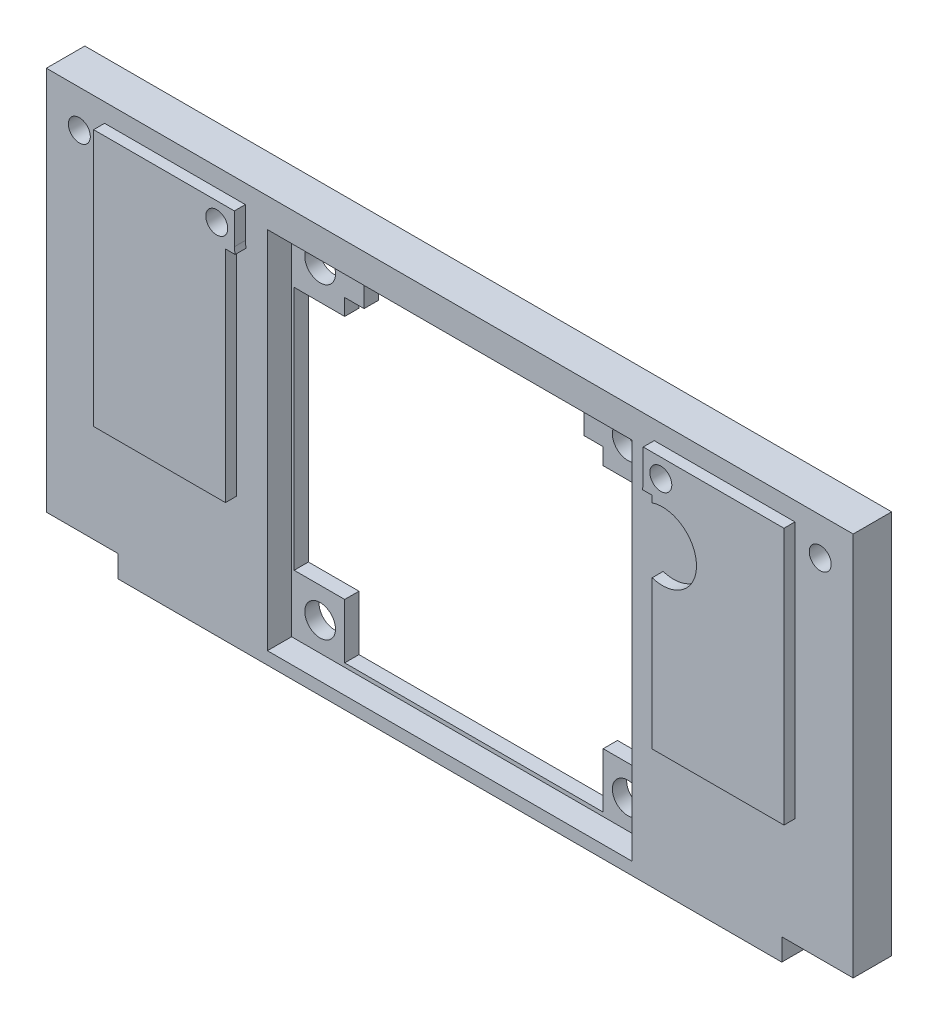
ISO-10303-21;
HEADER;
FILE_DESCRIPTION(('STEP AP214'),'2;1');
FILE_NAME('part.step','',(''),(''),'','','');
FILE_SCHEMA(('AUTOMOTIVE_DESIGN { 1 0 10303 214 1 1 1 1 }'));
ENDSEC;
DATA;
#1=APPLICATION_CONTEXT('core data for automotive mechanical design processes');
#2=APPLICATION_PROTOCOL_DEFINITION('international standard','automotive_design',2000,#1);
#3=PRODUCT_CONTEXT('',#1,'mechanical');
#4=PRODUCT('Part','Part','',(#3));
#5=PRODUCT_RELATED_PRODUCT_CATEGORY('part','',(#4));
#6=PRODUCT_DEFINITION_FORMATION('','',#4);
#7=PRODUCT_DEFINITION_CONTEXT('part definition',#1,'design');
#8=PRODUCT_DEFINITION('design','',#6,#7);
#9=PRODUCT_DEFINITION_SHAPE('','',#8);
#10=(LENGTH_UNIT() NAMED_UNIT(*) SI_UNIT(.MILLI.,.METRE.));
#11=(NAMED_UNIT(*) PLANE_ANGLE_UNIT() SI_UNIT($,.RADIAN.));
#12=(NAMED_UNIT(*) SI_UNIT($,.STERADIAN.) SOLID_ANGLE_UNIT());
#13=UNCERTAINTY_MEASURE_WITH_UNIT(LENGTH_MEASURE(1.E-05),#10,'distance_accuracy_value','');
#14=(GEOMETRIC_REPRESENTATION_CONTEXT(3) GLOBAL_UNCERTAINTY_ASSIGNED_CONTEXT((#13)) GLOBAL_UNIT_ASSIGNED_CONTEXT((#10,
#11,#12)) REPRESENTATION_CONTEXT('',''));
#15=CARTESIAN_POINT('',(0.,0.,0.));
#16=DIRECTION('',(0.,0.,1.));
#17=DIRECTION('',(1.,0.,0.));
#18=AXIS2_PLACEMENT_3D('',#15,#16,#17);
#19=CARTESIAN_POINT('',(16.203178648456,30.9429025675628,4.5));
#20=DIRECTION('',(-1.,0.,0.));
#21=DIRECTION('',(0.,-1.,0.));
#22=AXIS2_PLACEMENT_3D('',#19,#20,#21);
#23=PLANE('',#22);
#24=DIRECTION('',(0.,0.,1.));
#25=VECTOR('',#24,1.);
#26=CARTESIAN_POINT('',(16.203178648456,24.4379885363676,-5.2681240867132));
#27=LINE('',#26,#25);
#28=CARTESIAN_POINT('',(16.203178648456,24.4379885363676,3.5));
#29=VERTEX_POINT('',#28);
#30=CARTESIAN_POINT('',(16.203178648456,24.4379885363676,4.5));
#31=VERTEX_POINT('',#30);
#32=EDGE_CURVE('E716',#29,#31,#27,.T.);
#33=ORIENTED_EDGE('',*,*,#32,.F.);
#34=DIRECTION('',(0.,1.,0.));
#35=VECTOR('',#34,1.);
#36=CARTESIAN_POINT('',(16.203178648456,30.9429025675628,3.5));
#37=LINE('',#36,#35);
#38=CARTESIAN_POINT('',(16.203178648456,10.9429025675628,3.5));
#39=VERTEX_POINT('',#38);
#40=EDGE_CURVE('E756',#39,#29,#37,.T.);
#41=ORIENTED_EDGE('',*,*,#40,.F.);
#42=DIRECTION('',(0.,0.,-1.));
#43=VECTOR('',#42,1.);
#44=CARTESIAN_POINT('',(16.203178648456,10.9429025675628,4.5));
#45=LINE('',#44,#43);
#46=CARTESIAN_POINT('',(16.203178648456,10.9429025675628,4.5));
#47=VERTEX_POINT('',#46);
#48=EDGE_CURVE('E770',#47,#39,#45,.T.);
#49=ORIENTED_EDGE('',*,*,#48,.F.);
#50=DIRECTION('',(0.,1.,0.));
#51=VECTOR('',#50,1.);
#52=CARTESIAN_POINT('',(16.203178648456,30.9429025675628,4.5));
#53=LINE('',#52,#51);
#54=EDGE_CURVE('E730',#47,#31,#53,.T.);
#55=ORIENTED_EDGE('',*,*,#54,.T.);
#56=EDGE_LOOP('',(#33,#41,#49,#55));
#57=FACE_BOUND('',#56,.T.);
#58=ADVANCED_FACE('F45',(#57),#23,.T.);
#59=CARTESIAN_POINT('',(0.,0.,3.5));
#60=DIRECTION('',(0.,0.,1.));
#61=DIRECTION('',(1.,0.,0.));
#62=AXIS2_PLACEMENT_3D('',#59,#60,#61);
#63=PLANE('',#62);
#64=DIRECTION('',(-1.,0.,0.));
#65=VECTOR('',#64,1.);
#66=CARTESIAN_POINT('',(-39.936821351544,1.03737218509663,3.5));
#67=LINE('',#66,#65);
#68=CARTESIAN_POINT('',(-33.436821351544,1.03737218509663,3.5));
#69=VERTEX_POINT('',#68);
#70=CARTESIAN_POINT('',(-39.936821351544,1.03737218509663,3.5));
#71=VERTEX_POINT('',#70);
#72=EDGE_CURVE('E335',#69,#71,#67,.T.);
#73=ORIENTED_EDGE('',*,*,#72,.F.);
#74=DIRECTION('',(0.,1.,0.));
#75=VECTOR('',#74,1.);
#76=CARTESIAN_POINT('',(-33.436821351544,-0.962627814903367,3.5));
#77=LINE('',#76,#75);
#78=CARTESIAN_POINT('',(-33.436821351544,-0.962627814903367,3.5));
#79=VERTEX_POINT('',#78);
#80=EDGE_CURVE('E1412',#79,#69,#77,.T.);
#81=ORIENTED_EDGE('',*,*,#80,.F.);
#82=DIRECTION('',(1.,0.,0.));
#83=VECTOR('',#82,1.);
#84=CARTESIAN_POINT('',(0.,-0.962627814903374,3.5));
#85=LINE('',#84,#83);
#86=CARTESIAN_POINT('',(27.003178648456,-0.962627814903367,3.5));
#87=VERTEX_POINT('',#86);
#88=EDGE_CURVE('E344',#79,#87,#85,.T.);
#89=ORIENTED_EDGE('',*,*,#88,.T.);
#90=DIRECTION('',(0.,-1.,0.));
#91=VECTOR('',#90,1.);
#92=CARTESIAN_POINT('',(27.003178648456,-0.962627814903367,3.5));
#93=LINE('',#92,#91);
#94=CARTESIAN_POINT('',(27.003178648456,1.03737218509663,3.5));
#95=VERTEX_POINT('',#94);
#96=EDGE_CURVE('E1442',#95,#87,#93,.T.);
#97=ORIENTED_EDGE('',*,*,#96,.F.);
#98=DIRECTION('',(-1.,0.,0.));
#99=VECTOR('',#98,1.);
#100=CARTESIAN_POINT('',(33.503178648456,1.03737218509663,3.5));
#101=LINE('',#100,#99);
#102=CARTESIAN_POINT('',(33.503178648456,1.03737218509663,3.5));
#103=VERTEX_POINT('',#102);
#104=EDGE_CURVE('E1429',#103,#95,#101,.T.);
#105=ORIENTED_EDGE('',*,*,#104,.F.);
#106=DIRECTION('',(0.,1.,0.));
#107=VECTOR('',#106,1.);
#108=CARTESIAN_POINT('',(33.503178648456,0.,3.5));
#109=LINE('',#108,#107);
#110=CARTESIAN_POINT('',(33.503178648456,36.0373721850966,3.5));
#111=VERTEX_POINT('',#110);
#112=EDGE_CURVE('E625',#103,#111,#109,.T.);
#113=ORIENTED_EDGE('',*,*,#112,.T.);
#114=DIRECTION('',(-1.,0.,0.));
#115=VECTOR('',#114,1.);
#116=CARTESIAN_POINT('',(0.,36.0373721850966,3.5));
#117=LINE('',#116,#115);
#118=CARTESIAN_POINT('',(-39.936821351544,36.0373721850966,3.5));
#119=VERTEX_POINT('',#118);
#120=EDGE_CURVE('E628',#111,#119,#117,.T.);
#121=ORIENTED_EDGE('',*,*,#120,.T.);
#122=DIRECTION('',(0.,1.,0.));
#123=VECTOR('',#122,1.);
#124=CARTESIAN_POINT('',(-39.936821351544,0.,3.5));
#125=LINE('',#124,#123);
#126=EDGE_CURVE('E462',#71,#119,#125,.T.);
#127=ORIENTED_EDGE('',*,*,#126,.F.);
#128=EDGE_LOOP('',(#73,#81,#89,#97,#105,#113,#121,#127));
#129=FACE_BOUND('',#128,.T.);
#130=ORIENTED_EDGE('',*,*,#40,.T.);
#131=CARTESIAN_POINT('',(17.1422149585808,27.3923430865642,3.5));
#132=DIRECTION('',(0.,0.,1.));
#133=DIRECTION('',(1.,0.,0.));
#134=AXIS2_PLACEMENT_3D('',#131,#132,#133);
#135=CIRCLE('',#134,3.1);
#136=CARTESIAN_POINT('',(16.203178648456,30.3466976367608,3.5));
#137=VERTEX_POINT('',#136);
#138=EDGE_CURVE('E717',#137,#29,#135,.F.);
#139=ORIENTED_EDGE('',*,*,#138,.F.);
#140=CARTESIAN_POINT('',(16.203178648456,30.9429025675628,3.5));
#141=VERTEX_POINT('',#140);
#142=EDGE_CURVE('E712',#137,#141,#37,.T.);
#143=ORIENTED_EDGE('',*,*,#142,.T.);
#144=DIRECTION('',(-1.,0.,0.));
#145=VECTOR('',#144,1.);
#146=CARTESIAN_POINT('',(16.203178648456,30.9429025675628,3.5));
#147=LINE('',#146,#145);
#148=CARTESIAN_POINT('',(15.3182858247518,30.9429025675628,3.5));
#149=VERTEX_POINT('',#148);
#150=EDGE_CURVE('E753',#141,#149,#147,.T.);
#151=ORIENTED_EDGE('',*,*,#150,.T.);
#152=CARTESIAN_POINT('',(11.7069803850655,31.7070385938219,3.5));
#153=DIRECTION('',(0.,0.,1.));
#154=DIRECTION('',(-1.,0.,0.));
#155=AXIS2_PLACEMENT_3D('',#152,#153,#154);
#156=CIRCLE('',#155,3.69126412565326);
#157=CARTESIAN_POINT('',(15.393178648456,31.5137170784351,3.5));
#158=VERTEX_POINT('',#157);
#159=EDGE_CURVE('E750',#149,#158,#156,.T.);
#160=ORIENTED_EDGE('',*,*,#159,.T.);
#161=DIRECTION('',(0.,1.,0.));
#162=VECTOR('',#161,1.);
#163=CARTESIAN_POINT('',(15.393178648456,34.3429025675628,3.5));
#164=LINE('',#163,#162);
#165=CARTESIAN_POINT('',(15.393178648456,34.3429025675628,3.5));
#166=VERTEX_POINT('',#165);
#167=EDGE_CURVE('E746',#158,#166,#164,.T.);
#168=ORIENTED_EDGE('',*,*,#167,.T.);
#169=DIRECTION('',(1.,0.,0.));
#170=VECTOR('',#169,1.);
#171=CARTESIAN_POINT('',(15.393178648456,34.3429025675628,3.5));
#172=LINE('',#171,#170);
#173=CARTESIAN_POINT('',(28.203178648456,34.3429025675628,3.5));
#174=VERTEX_POINT('',#173);
#175=EDGE_CURVE('E743',#166,#174,#172,.T.);
#176=ORIENTED_EDGE('',*,*,#175,.T.);
#177=DIRECTION('',(0.,-1.,0.));
#178=VECTOR('',#177,1.);
#179=CARTESIAN_POINT('',(28.203178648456,30.9429025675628,3.5));
#180=LINE('',#179,#178);
#181=CARTESIAN_POINT('',(28.203178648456,10.9429025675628,3.5));
#182=VERTEX_POINT('',#181);
#183=EDGE_CURVE('E763',#174,#182,#180,.T.);
#184=ORIENTED_EDGE('',*,*,#183,.T.);
#185=DIRECTION('',(-1.,0.,0.));
#186=VECTOR('',#185,1.);
#187=CARTESIAN_POINT('',(28.203178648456,10.9429025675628,3.5));
#188=LINE('',#187,#186);
#189=EDGE_CURVE('E760',#182,#39,#188,.T.);
#190=ORIENTED_EDGE('',*,*,#189,.T.);
#191=EDGE_LOOP('',(#130,#139,#143,#151,#160,#168,#176,#184,#190));
#192=FACE_BOUND('',#191,.T.);
#193=DIRECTION('',(-1.,0.,0.));
#194=VECTOR('',#193,1.);
#195=CARTESIAN_POINT('',(13.383178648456,0.177902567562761,3.5));
#196=LINE('',#195,#194);
#197=CARTESIAN_POINT('',(13.383178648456,0.177902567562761,3.5));
#198=VERTEX_POINT('',#197);
#199=CARTESIAN_POINT('',(-19.816821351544,0.177902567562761,3.5));
#200=VERTEX_POINT('',#199);
#201=EDGE_CURVE('E524',#198,#200,#196,.T.);
#202=ORIENTED_EDGE('',*,*,#201,.T.);
#203=DIRECTION('',(0.,1.,0.));
#204=VECTOR('',#203,1.);
#205=CARTESIAN_POINT('',(-19.816821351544,0.177902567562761,3.5));
#206=LINE('',#205,#204);
#207=CARTESIAN_POINT('',(-19.816821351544,33.3779025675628,3.5));
#208=VERTEX_POINT('',#207);
#209=EDGE_CURVE('E494',#200,#208,#206,.T.);
#210=ORIENTED_EDGE('',*,*,#209,.T.);
#211=DIRECTION('',(1.,0.,0.));
#212=VECTOR('',#211,1.);
#213=CARTESIAN_POINT('',(13.383178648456,33.3779025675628,3.5));
#214=LINE('',#213,#212);
#215=CARTESIAN_POINT('',(13.383178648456,33.3779025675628,3.5));
#216=VERTEX_POINT('',#215);
#217=EDGE_CURVE('E537',#208,#216,#214,.T.);
#218=ORIENTED_EDGE('',*,*,#217,.T.);
#219=DIRECTION('',(0.,-1.,0.));
#220=VECTOR('',#219,1.);
#221=CARTESIAN_POINT('',(13.383178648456,0.177902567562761,3.5));
#222=LINE('',#221,#220);
#223=EDGE_CURVE('E541',#216,#198,#222,.T.);
#224=ORIENTED_EDGE('',*,*,#223,.T.);
#225=EDGE_LOOP('',(#202,#210,#218,#224));
#226=FACE_BOUND('',#225,.T.);
#227=CARTESIAN_POINT('',(30.503178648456,32.6429025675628,3.5));
#228=DIRECTION('',(0.,0.,1.));
#229=DIRECTION('',(1.,0.,0.));
#230=AXIS2_PLACEMENT_3D('',#227,#228,#229);
#231=CIRCLE('',#230,1.);
#232=CARTESIAN_POINT('',(31.503178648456,32.6429025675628,3.5));
#233=VERTEX_POINT('',#232);
#234=EDGE_CURVE('E418',#233,#233,#231,.T.);
#235=ORIENTED_EDGE('',*,*,#234,.F.);
#236=EDGE_LOOP('',(#235));
#237=FACE_BOUND('',#236,.T.);
#238=CARTESIAN_POINT('',(-36.936821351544,32.6429025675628,3.5));
#239=DIRECTION('',(0.,0.,1.));
#240=DIRECTION('',(1.,0.,0.));
#241=AXIS2_PLACEMENT_3D('',#238,#239,#240);
#242=CIRCLE('',#241,0.999999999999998);
#243=CARTESIAN_POINT('',(-35.936821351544,32.6429025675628,3.5));
#244=VERTEX_POINT('',#243);
#245=EDGE_CURVE('E619',#244,#244,#242,.T.);
#246=ORIENTED_EDGE('',*,*,#245,.F.);
#247=EDGE_LOOP('',(#246));
#248=FACE_BOUND('',#247,.T.);
#249=DIRECTION('',(1.,0.,0.));
#250=VECTOR('',#249,1.);
#251=CARTESIAN_POINT('',(-34.636821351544,10.9429025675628,3.5));
#252=LINE('',#251,#250);
#253=CARTESIAN_POINT('',(-34.636821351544,10.9429025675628,3.5));
#254=VERTEX_POINT('',#253);
#255=CARTESIAN_POINT('',(-22.636821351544,10.9429025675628,3.5));
#256=VERTEX_POINT('',#255);
#257=EDGE_CURVE('E823',#254,#256,#252,.T.);
#258=ORIENTED_EDGE('',*,*,#257,.F.);
#259=DIRECTION('',(0.,-1.,0.));
#260=VECTOR('',#259,1.);
#261=CARTESIAN_POINT('',(-34.636821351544,30.9429025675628,3.5));
#262=LINE('',#261,#260);
#263=CARTESIAN_POINT('',(-34.636821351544,34.3429025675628,3.5));
#264=VERTEX_POINT('',#263);
#265=EDGE_CURVE('E797',#264,#254,#262,.T.);
#266=ORIENTED_EDGE('',*,*,#265,.F.);
#267=DIRECTION('',(-1.,0.,0.));
#268=VECTOR('',#267,1.);
#269=CARTESIAN_POINT('',(-21.826821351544,34.3429025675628,3.5));
#270=LINE('',#269,#268);
#271=CARTESIAN_POINT('',(-21.826821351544,34.3429025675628,3.5));
#272=VERTEX_POINT('',#271);
#273=EDGE_CURVE('E802',#272,#264,#270,.T.);
#274=ORIENTED_EDGE('',*,*,#273,.F.);
#275=DIRECTION('',(0.,1.,0.));
#276=VECTOR('',#275,1.);
#277=CARTESIAN_POINT('',(-21.826821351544,34.3429025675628,3.5));
#278=LINE('',#277,#276);
#279=CARTESIAN_POINT('',(-21.826821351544,31.5137170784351,3.5));
#280=VERTEX_POINT('',#279);
#281=EDGE_CURVE('E835',#280,#272,#278,.T.);
#282=ORIENTED_EDGE('',*,*,#281,.F.);
#283=CARTESIAN_POINT('',(-18.1406230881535,31.7070385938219,3.5));
#284=DIRECTION('',(0.,0.,-1.));
#285=DIRECTION('',(1.,0.,0.));
#286=AXIS2_PLACEMENT_3D('',#283,#284,#285);
#287=CIRCLE('',#286,3.69126412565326);
#288=CARTESIAN_POINT('',(-21.7519285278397,30.9429025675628,3.5));
#289=VERTEX_POINT('',#288);
#290=EDGE_CURVE('E832',#289,#280,#287,.T.);
#291=ORIENTED_EDGE('',*,*,#290,.F.);
#292=DIRECTION('',(1.,0.,0.));
#293=VECTOR('',#292,1.);
#294=CARTESIAN_POINT('',(-22.636821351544,30.9429025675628,3.5));
#295=LINE('',#294,#293);
#296=CARTESIAN_POINT('',(-22.636821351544,30.9429025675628,3.5));
#297=VERTEX_POINT('',#296);
#298=EDGE_CURVE('E829',#297,#289,#295,.T.);
#299=ORIENTED_EDGE('',*,*,#298,.F.);
#300=DIRECTION('',(0.,1.,0.));
#301=VECTOR('',#300,1.);
#302=CARTESIAN_POINT('',(-22.636821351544,30.9429025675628,3.5));
#303=LINE('',#302,#301);
#304=EDGE_CURVE('E826',#256,#297,#303,.T.);
#305=ORIENTED_EDGE('',*,*,#304,.F.);
#306=EDGE_LOOP('',(#258,#266,#274,#282,#291,#299,#305));
#307=FACE_BOUND('',#306,.T.);
#308=ADVANCED_FACE('F680',(#129,#192,#226,#237,#248,#307),#63,.T.);
#309=CARTESIAN_POINT('',(0.,29.3429025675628,3.5));
#310=DIRECTION('',(0.,1.,0.));
#311=DIRECTION('',(-1.,0.,0.));
#312=AXIS2_PLACEMENT_3D('',#309,#310,#311);
#313=PLANE('',#312);
#314=DIRECTION('',(1.,0.,0.));
#315=VECTOR('',#314,1.);
#316=CARTESIAN_POINT('',(0.,29.3429025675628,1.3));
#317=LINE('',#316,#315);
#318=CARTESIAN_POINT('',(6.78317864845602,29.3429025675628,1.3));
#319=VERTEX_POINT('',#318);
#320=CARTESIAN_POINT('',(8.54817864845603,29.3429025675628,1.3));
#321=VERTEX_POINT('',#320);
#322=EDGE_CURVE('E568',#319,#321,#317,.T.);
#323=ORIENTED_EDGE('',*,*,#322,.F.);
#324=DIRECTION('',(0.,0.,-1.));
#325=VECTOR('',#324,1.);
#326=CARTESIAN_POINT('',(6.78317864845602,29.3429025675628,1.75));
#327=LINE('',#326,#325);
#328=CARTESIAN_POINT('',(6.78317864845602,29.3429025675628,0.));
#329=VERTEX_POINT('',#328);
#330=EDGE_CURVE('E483',#319,#329,#327,.T.);
#331=ORIENTED_EDGE('',*,*,#330,.T.);
#332=DIRECTION('',(1.,0.,0.));
#333=VECTOR('',#332,1.);
#334=CARTESIAN_POINT('',(0.,29.3429025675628,0.));
#335=LINE('',#334,#333);
#336=CARTESIAN_POINT('',(8.54817864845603,29.3429025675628,0.));
#337=VERTEX_POINT('',#336);
#338=EDGE_CURVE('E401',#329,#337,#335,.T.);
#339=ORIENTED_EDGE('',*,*,#338,.T.);
#340=DIRECTION('',(0.,0.,-1.));
#341=VECTOR('',#340,1.);
#342=CARTESIAN_POINT('',(8.54817864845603,29.3429025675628,3.5));
#343=LINE('',#342,#341);
#344=EDGE_CURVE('E429',#321,#337,#343,.T.);
#345=ORIENTED_EDGE('',*,*,#344,.F.);
#346=EDGE_LOOP('',(#323,#331,#339,#345));
#347=FACE_BOUND('',#346,.T.);
#348=ADVANCED_FACE('F687',(#347),#313,.F.);
#349=CARTESIAN_POINT('',(0.,5.53737218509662,3.5));
#350=DIRECTION('',(0.,1.,0.));
#351=DIRECTION('',(-1.,0.,0.));
#352=AXIS2_PLACEMENT_3D('',#349,#350,#351);
#353=PLANE('',#352);
#354=DIRECTION('',(0.,0.,-1.));
#355=VECTOR('',#354,1.);
#356=CARTESIAN_POINT('',(8.54817864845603,5.53737218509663,3.5));
#357=LINE('',#356,#355);
#358=CARTESIAN_POINT('',(8.54817864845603,5.53737218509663,1.3));
#359=VERTEX_POINT('',#358);
#360=CARTESIAN_POINT('',(8.54817864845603,5.53737218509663,0.));
#361=VERTEX_POINT('',#360);
#362=EDGE_CURVE('E454',#359,#361,#357,.T.);
#363=ORIENTED_EDGE('',*,*,#362,.F.);
#364=DIRECTION('',(1.,0.,0.));
#365=VECTOR('',#364,1.);
#366=CARTESIAN_POINT('',(0.,5.53737218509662,1.3));
#367=LINE('',#366,#365);
#368=CARTESIAN_POINT('',(13.148178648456,5.53737218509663,1.3));
#369=VERTEX_POINT('',#368);
#370=EDGE_CURVE('E595',#359,#369,#367,.T.);
#371=ORIENTED_EDGE('',*,*,#370,.T.);
#372=DIRECTION('',(0.,0.,-1.));
#373=VECTOR('',#372,1.);
#374=CARTESIAN_POINT('',(13.148178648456,5.53737218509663,3.5));
#375=LINE('',#374,#373);
#376=CARTESIAN_POINT('',(13.148178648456,5.53737218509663,0.));
#377=VERTEX_POINT('',#376);
#378=EDGE_CURVE('E419',#369,#377,#375,.T.);
#379=ORIENTED_EDGE('',*,*,#378,.T.);
#380=DIRECTION('',(1.,0.,0.));
#381=VECTOR('',#380,1.);
#382=CARTESIAN_POINT('',(0.,5.53737218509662,0.));
#383=LINE('',#382,#381);
#384=EDGE_CURVE('E369',#361,#377,#383,.T.);
#385=ORIENTED_EDGE('',*,*,#384,.F.);
#386=EDGE_LOOP('',(#363,#371,#379,#385));
#387=FACE_BOUND('',#386,.T.);
#388=ADVANCED_FACE('F894',(#387),#353,.T.);
#389=CARTESIAN_POINT('',(8.54817864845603,0.,3.5));
#390=DIRECTION('',(1.,0.,0.));
#391=DIRECTION('',(0.,1.,0.));
#392=AXIS2_PLACEMENT_3D('',#389,#390,#391);
#393=PLANE('',#392);
#394=DIRECTION('',(0.,-1.,0.));
#395=VECTOR('',#394,1.);
#396=CARTESIAN_POINT('',(8.54817864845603,0.,1.3));
#397=LINE('',#396,#395);
#398=CARTESIAN_POINT('',(8.54817864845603,0.537372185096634,1.3));
#399=VERTEX_POINT('',#398);
#400=EDGE_CURVE('E592',#359,#399,#397,.T.);
#401=ORIENTED_EDGE('',*,*,#400,.F.);
#402=ORIENTED_EDGE('',*,*,#362,.T.);
#403=DIRECTION('',(0.,-1.,0.));
#404=VECTOR('',#403,1.);
#405=CARTESIAN_POINT('',(8.54817864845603,0.,0.));
#406=LINE('',#405,#404);
#407=CARTESIAN_POINT('',(8.54817864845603,0.537372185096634,0.));
#408=VERTEX_POINT('',#407);
#409=EDGE_CURVE('E373',#361,#408,#406,.T.);
#410=ORIENTED_EDGE('',*,*,#409,.T.);
#411=DIRECTION('',(0.,0.,-1.));
#412=VECTOR('',#411,1.);
#413=CARTESIAN_POINT('',(8.54817864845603,0.537372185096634,3.5));
#414=LINE('',#413,#412);
#415=EDGE_CURVE('E451',#399,#408,#414,.T.);
#416=ORIENTED_EDGE('',*,*,#415,.F.);
#417=EDGE_LOOP('',(#401,#402,#410,#416));
#418=FACE_BOUND('',#417,.T.);
#419=ADVANCED_FACE('F901',(#418),#393,.F.);
#420=CARTESIAN_POINT('',(0.,0.537372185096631,3.5));
#421=DIRECTION('',(0.,-1.,0.));
#422=DIRECTION('',(1.,0.,0.));
#423=AXIS2_PLACEMENT_3D('',#420,#421,#422);
#424=PLANE('',#423);
#425=DIRECTION('',(-1.,0.,0.));
#426=VECTOR('',#425,1.);
#427=CARTESIAN_POINT('',(0.,0.537372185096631,1.3));
#428=LINE('',#427,#426);
#429=CARTESIAN_POINT('',(-14.981821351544,0.537372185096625,1.3));
#430=VERTEX_POINT('',#429);
#431=EDGE_CURVE('E589',#399,#430,#428,.T.);
#432=ORIENTED_EDGE('',*,*,#431,.F.);
#433=ORIENTED_EDGE('',*,*,#415,.T.);
#434=DIRECTION('',(-1.,0.,0.));
#435=VECTOR('',#434,1.);
#436=CARTESIAN_POINT('',(0.,0.537372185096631,0.));
#437=LINE('',#436,#435);
#438=CARTESIAN_POINT('',(-14.981821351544,0.537372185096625,0.));
#439=VERTEX_POINT('',#438);
#440=EDGE_CURVE('E377',#408,#439,#437,.T.);
#441=ORIENTED_EDGE('',*,*,#440,.T.);
#442=DIRECTION('',(0.,0.,-1.));
#443=VECTOR('',#442,1.);
#444=CARTESIAN_POINT('',(-14.981821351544,0.537372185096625,3.5));
#445=LINE('',#444,#443);
#446=EDGE_CURVE('E448',#430,#439,#445,.T.);
#447=ORIENTED_EDGE('',*,*,#446,.F.);
#448=EDGE_LOOP('',(#432,#433,#441,#447));
#449=FACE_BOUND('',#448,.T.);
#450=ADVANCED_FACE('F906',(#449),#424,.F.);
#451=CARTESIAN_POINT('',(-14.981821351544,0.,3.5));
#452=DIRECTION('',(-1.,0.,0.));
#453=DIRECTION('',(0.,0.,1.));
#454=AXIS2_PLACEMENT_3D('',#451,#452,#453);
#455=PLANE('',#454);
#456=DIRECTION('',(0.,1.,0.));
#457=VECTOR('',#456,1.);
#458=CARTESIAN_POINT('',(-14.981821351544,0.,1.3));
#459=LINE('',#458,#457);
#460=CARTESIAN_POINT('',(-14.981821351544,5.53737218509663,1.3));
#461=VERTEX_POINT('',#460);
#462=EDGE_CURVE('E586',#430,#461,#459,.T.);
#463=ORIENTED_EDGE('',*,*,#462,.F.);
#464=ORIENTED_EDGE('',*,*,#446,.T.);
#465=DIRECTION('',(0.,1.,0.));
#466=VECTOR('',#465,1.);
#467=CARTESIAN_POINT('',(-14.981821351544,0.,0.));
#468=LINE('',#467,#466);
#469=CARTESIAN_POINT('',(-14.981821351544,5.53737218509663,0.));
#470=VERTEX_POINT('',#469);
#471=EDGE_CURVE('E381',#439,#470,#468,.T.);
#472=ORIENTED_EDGE('',*,*,#471,.T.);
#473=DIRECTION('',(0.,0.,-1.));
#474=VECTOR('',#473,1.);
#475=CARTESIAN_POINT('',(-14.981821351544,5.53737218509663,3.5));
#476=LINE('',#475,#474);
#477=EDGE_CURVE('E445',#461,#470,#476,.T.);
#478=ORIENTED_EDGE('',*,*,#477,.F.);
#479=EDGE_LOOP('',(#463,#464,#472,#478));
#480=FACE_BOUND('',#479,.T.);
#481=ADVANCED_FACE('F908',(#480),#455,.F.);
#482=CARTESIAN_POINT('',(0.,5.53737218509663,3.5));
#483=DIRECTION('',(0.,1.,0.));
#484=DIRECTION('',(0.,0.,1.));
#485=AXIS2_PLACEMENT_3D('',#482,#483,#484);
#486=PLANE('',#485);
#487=DIRECTION('',(0.,0.,-1.));
#488=VECTOR('',#487,1.);
#489=CARTESIAN_POINT('',(-19.581821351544,5.53737218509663,3.5));
#490=LINE('',#489,#488);
#491=CARTESIAN_POINT('',(-19.581821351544,5.53737218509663,1.3));
#492=VERTEX_POINT('',#491);
#493=CARTESIAN_POINT('',(-19.581821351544,5.53737218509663,0.));
#494=VERTEX_POINT('',#493);
#495=EDGE_CURVE('E442',#492,#494,#490,.T.);
#496=ORIENTED_EDGE('',*,*,#495,.F.);
#497=DIRECTION('',(1.,0.,0.));
#498=VECTOR('',#497,1.);
#499=CARTESIAN_POINT('',(0.,5.53737218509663,1.3));
#500=LINE('',#499,#498);
#501=EDGE_CURVE('E582',#492,#461,#500,.T.);
#502=ORIENTED_EDGE('',*,*,#501,.T.);
#503=ORIENTED_EDGE('',*,*,#477,.T.);
#504=DIRECTION('',(1.,0.,0.));
#505=VECTOR('',#504,1.);
#506=CARTESIAN_POINT('',(0.,5.53737218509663,0.));
#507=LINE('',#506,#505);
#508=EDGE_CURVE('E385',#494,#470,#507,.T.);
#509=ORIENTED_EDGE('',*,*,#508,.F.);
#510=EDGE_LOOP('',(#496,#502,#503,#509));
#511=FACE_BOUND('',#510,.T.);
#512=ADVANCED_FACE('F914',(#511),#486,.T.);
#513=CARTESIAN_POINT('',(-19.581821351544,0.,3.5));
#514=DIRECTION('',(1.,0.,0.));
#515=DIRECTION('',(0.,1.,0.));
#516=AXIS2_PLACEMENT_3D('',#513,#514,#515);
#517=PLANE('',#516);
#518=DIRECTION('',(0.,0.,-1.));
#519=VECTOR('',#518,1.);
#520=CARTESIAN_POINT('',(-19.581821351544,27.8429025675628,3.5));
#521=LINE('',#520,#519);
#522=CARTESIAN_POINT('',(-19.581821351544,27.8429025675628,1.3));
#523=VERTEX_POINT('',#522);
#524=CARTESIAN_POINT('',(-19.581821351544,27.8429025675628,0.));
#525=VERTEX_POINT('',#524);
#526=EDGE_CURVE('E439',#523,#525,#521,.T.);
#527=ORIENTED_EDGE('',*,*,#526,.F.);
#528=DIRECTION('',(0.,-1.,0.));
#529=VECTOR('',#528,1.);
#530=CARTESIAN_POINT('',(-19.581821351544,0.,1.3));
#531=LINE('',#530,#529);
#532=EDGE_CURVE('E578',#523,#492,#531,.T.);
#533=ORIENTED_EDGE('',*,*,#532,.T.);
#534=ORIENTED_EDGE('',*,*,#495,.T.);
#535=DIRECTION('',(0.,-1.,0.));
#536=VECTOR('',#535,1.);
#537=CARTESIAN_POINT('',(-19.581821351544,0.,0.));
#538=LINE('',#537,#536);
#539=EDGE_CURVE('E389',#525,#494,#538,.T.);
#540=ORIENTED_EDGE('',*,*,#539,.F.);
#541=EDGE_LOOP('',(#527,#533,#534,#540));
#542=FACE_BOUND('',#541,.T.);
#543=ADVANCED_FACE('F917',(#542),#517,.T.);
#544=CARTESIAN_POINT('',(0.,27.8429025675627,3.5));
#545=DIRECTION('',(0.,-1.,0.));
#546=DIRECTION('',(1.,0.,0.));
#547=AXIS2_PLACEMENT_3D('',#544,#545,#546);
#548=PLANE('',#547);
#549=DIRECTION('',(0.,0.,-1.));
#550=VECTOR('',#549,1.);
#551=CARTESIAN_POINT('',(-14.981821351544,27.8429025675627,3.5));
#552=LINE('',#551,#550);
#553=CARTESIAN_POINT('',(-14.981821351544,27.8429025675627,1.3));
#554=VERTEX_POINT('',#553);
#555=CARTESIAN_POINT('',(-14.981821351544,27.8429025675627,0.));
#556=VERTEX_POINT('',#555);
#557=EDGE_CURVE('E436',#554,#556,#552,.T.);
#558=ORIENTED_EDGE('',*,*,#557,.F.);
#559=DIRECTION('',(-1.,0.,0.));
#560=VECTOR('',#559,1.);
#561=CARTESIAN_POINT('',(0.,27.8429025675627,1.3));
#562=LINE('',#561,#560);
#563=EDGE_CURVE('E574',#554,#523,#562,.T.);
#564=ORIENTED_EDGE('',*,*,#563,.T.);
#565=ORIENTED_EDGE('',*,*,#526,.T.);
#566=DIRECTION('',(-1.,0.,0.));
#567=VECTOR('',#566,1.);
#568=CARTESIAN_POINT('',(0.,27.8429025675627,0.));
#569=LINE('',#568,#567);
#570=EDGE_CURVE('E393',#556,#525,#569,.T.);
#571=ORIENTED_EDGE('',*,*,#570,.F.);
#572=EDGE_LOOP('',(#558,#564,#565,#571));
#573=FACE_BOUND('',#572,.T.);
#574=ADVANCED_FACE('F921',(#573),#548,.T.);
#575=CARTESIAN_POINT('',(-14.981821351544,0.,3.5));
#576=DIRECTION('',(-1.,0.,0.));
#577=DIRECTION('',(0.,0.,1.));
#578=AXIS2_PLACEMENT_3D('',#575,#576,#577);
#579=PLANE('',#578);
#580=DIRECTION('',(0.,1.,0.));
#581=VECTOR('',#580,1.);
#582=CARTESIAN_POINT('',(-14.981821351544,0.,1.3));
#583=LINE('',#582,#581);
#584=CARTESIAN_POINT('',(-14.981821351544,29.3429025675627,1.3));
#585=VERTEX_POINT('',#584);
#586=EDGE_CURVE('E571',#554,#585,#583,.T.);
#587=ORIENTED_EDGE('',*,*,#586,.F.);
#588=ORIENTED_EDGE('',*,*,#557,.T.);
#589=DIRECTION('',(0.,1.,0.));
#590=VECTOR('',#589,1.);
#591=CARTESIAN_POINT('',(-14.981821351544,0.,0.));
#592=LINE('',#591,#590);
#593=CARTESIAN_POINT('',(-14.981821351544,29.3429025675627,0.));
#594=VERTEX_POINT('',#593);
#595=EDGE_CURVE('E397',#556,#594,#592,.T.);
#596=ORIENTED_EDGE('',*,*,#595,.T.);
#597=DIRECTION('',(0.,0.,-1.));
#598=VECTOR('',#597,1.);
#599=CARTESIAN_POINT('',(-14.981821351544,29.3429025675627,3.5));
#600=LINE('',#599,#598);
#601=EDGE_CURVE('E433',#585,#594,#600,.T.);
#602=ORIENTED_EDGE('',*,*,#601,.F.);
#603=EDGE_LOOP('',(#587,#588,#596,#602));
#604=FACE_BOUND('',#603,.T.);
#605=ADVANCED_FACE('F924',(#604),#579,.F.);
#606=CARTESIAN_POINT('',(-13.216821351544,29.3429025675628,0.));
#607=VERTEX_POINT('',#606);
#608=EDGE_CURVE('E402',#594,#607,#335,.T.);
#609=ORIENTED_EDGE('',*,*,#608,.T.);
#610=DIRECTION('',(0.,0.,-1.));
#611=VECTOR('',#610,1.);
#612=CARTESIAN_POINT('',(-13.216821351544,29.3429025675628,1.75));
#613=LINE('',#612,#611);
#614=CARTESIAN_POINT('',(-13.216821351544,29.3429025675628,1.3));
#615=VERTEX_POINT('',#614);
#616=EDGE_CURVE('E506',#615,#607,#613,.T.);
#617=ORIENTED_EDGE('',*,*,#616,.F.);
#618=EDGE_CURVE('E501',#585,#615,#317,.T.);
#619=ORIENTED_EDGE('',*,*,#618,.F.);
#620=ORIENTED_EDGE('',*,*,#601,.T.);
#621=EDGE_LOOP('',(#609,#617,#619,#620));
#622=FACE_BOUND('',#621,.T.);
#623=ADVANCED_FACE('F509',(#622),#313,.F.);
#624=CARTESIAN_POINT('',(8.54817864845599,0.,3.5));
#625=DIRECTION('',(1.,0.,0.));
#626=DIRECTION('',(0.,1.,0.));
#627=AXIS2_PLACEMENT_3D('',#624,#625,#626);
#628=PLANE('',#627);
#629=DIRECTION('',(0.,-1.,0.));
#630=VECTOR('',#629,1.);
#631=CARTESIAN_POINT('',(8.54817864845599,0.,1.3));
#632=LINE('',#631,#630);
#633=CARTESIAN_POINT('',(8.54817864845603,27.8429025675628,1.3));
#634=VERTEX_POINT('',#633);
#635=EDGE_CURVE('E565',#321,#634,#632,.T.);
#636=ORIENTED_EDGE('',*,*,#635,.F.);
#637=ORIENTED_EDGE('',*,*,#344,.T.);
#638=DIRECTION('',(0.,-1.,0.));
#639=VECTOR('',#638,1.);
#640=CARTESIAN_POINT('',(8.54817864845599,0.,0.));
#641=LINE('',#640,#639);
#642=CARTESIAN_POINT('',(8.54817864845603,27.8429025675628,0.));
#643=VERTEX_POINT('',#642);
#644=EDGE_CURVE('E406',#337,#643,#641,.T.);
#645=ORIENTED_EDGE('',*,*,#644,.T.);
#646=DIRECTION('',(0.,0.,-1.));
#647=VECTOR('',#646,1.);
#648=CARTESIAN_POINT('',(8.54817864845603,27.8429025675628,3.5));
#649=LINE('',#648,#647);
#650=EDGE_CURVE('E426',#634,#643,#649,.T.);
#651=ORIENTED_EDGE('',*,*,#650,.F.);
#652=EDGE_LOOP('',(#636,#637,#645,#651));
#653=FACE_BOUND('',#652,.T.);
#654=ADVANCED_FACE('F882',(#653),#628,.F.);
#655=CARTESIAN_POINT('',(0.,27.8429025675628,3.5));
#656=DIRECTION('',(0.,-1.,0.));
#657=DIRECTION('',(0.,0.,-1.));
#658=AXIS2_PLACEMENT_3D('',#655,#656,#657);
#659=PLANE('',#658);
#660=DIRECTION('',(0.,0.,-1.));
#661=VECTOR('',#660,1.);
#662=CARTESIAN_POINT('',(13.148178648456,27.8429025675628,3.5));
#663=LINE('',#662,#661);
#664=CARTESIAN_POINT('',(13.148178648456,27.8429025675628,1.3));
#665=VERTEX_POINT('',#664);
#666=CARTESIAN_POINT('',(13.148178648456,27.8429025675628,0.));
#667=VERTEX_POINT('',#666);
#668=EDGE_CURVE('E422',#665,#667,#663,.T.);
#669=ORIENTED_EDGE('',*,*,#668,.F.);
#670=DIRECTION('',(-1.,0.,0.));
#671=VECTOR('',#670,1.);
#672=CARTESIAN_POINT('',(0.,27.8429025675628,1.3));
#673=LINE('',#672,#671);
#674=EDGE_CURVE('E561',#665,#634,#673,.T.);
#675=ORIENTED_EDGE('',*,*,#674,.T.);
#676=ORIENTED_EDGE('',*,*,#650,.T.);
#677=DIRECTION('',(-1.,0.,0.));
#678=VECTOR('',#677,1.);
#679=CARTESIAN_POINT('',(0.,27.8429025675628,0.));
#680=LINE('',#679,#678);
#681=EDGE_CURVE('E410',#667,#643,#680,.T.);
#682=ORIENTED_EDGE('',*,*,#681,.F.);
#683=EDGE_LOOP('',(#669,#675,#676,#682));
#684=FACE_BOUND('',#683,.T.);
#685=ADVANCED_FACE('F886',(#684),#659,.T.);
#686=CARTESIAN_POINT('',(-17.216821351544,30.7779025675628,3.5));
#687=DIRECTION('',(0.,0.,-1.));
#688=DIRECTION('',(-1.,0.,0.));
#689=AXIS2_PLACEMENT_3D('',#686,#687,#688);
#690=CYLINDRICAL_SURFACE('',#689,1.4);
#691=CARTESIAN_POINT('',(-17.216821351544,30.7779025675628,0.));
#692=DIRECTION('',(0.,0.,1.));
#693=DIRECTION('',(1.,0.,0.));
#694=AXIS2_PLACEMENT_3D('',#691,#692,#693);
#695=CIRCLE('',#694,1.4);
#696=CARTESIAN_POINT('',(-15.816821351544,30.7779025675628,0.));
#697=VERTEX_POINT('',#696);
#698=EDGE_CURVE('E352',#697,#697,#695,.T.);
#699=ORIENTED_EDGE('',*,*,#698,.F.);
#700=EDGE_LOOP('',(#699));
#701=FACE_BOUND('',#700,.T.);
#702=CARTESIAN_POINT('',(-17.216821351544,30.7779025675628,1.3));
#703=DIRECTION('',(0.,0.,1.));
#704=DIRECTION('',(1.,0.,0.));
#705=AXIS2_PLACEMENT_3D('',#702,#703,#704);
#706=CIRCLE('',#705,1.4);
#707=CARTESIAN_POINT('',(-15.816821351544,30.7779025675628,1.3));
#708=VERTEX_POINT('',#707);
#709=EDGE_CURVE('E611',#708,#708,#706,.T.);
#710=ORIENTED_EDGE('',*,*,#709,.T.);
#711=EDGE_LOOP('',(#710));
#712=FACE_BOUND('',#711,.T.);
#713=ADVANCED_FACE('F956',(#701,#712),#690,.F.);
#714=CARTESIAN_POINT('',(-17.216821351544,2.77790256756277,3.5));
#715=DIRECTION('',(0.,0.,-1.));
#716=DIRECTION('',(-1.,0.,0.));
#717=AXIS2_PLACEMENT_3D('',#714,#715,#716);
#718=CYLINDRICAL_SURFACE('',#717,1.4);
#719=CARTESIAN_POINT('',(-17.216821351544,2.77790256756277,0.));
#720=DIRECTION('',(0.,0.,1.));
#721=DIRECTION('',(1.,0.,0.));
#722=AXIS2_PLACEMENT_3D('',#719,#720,#721);
#723=CIRCLE('',#722,1.4);
#724=CARTESIAN_POINT('',(-15.816821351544,2.77790256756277,0.));
#725=VERTEX_POINT('',#724);
#726=EDGE_CURVE('E641',#725,#725,#723,.T.);
#727=ORIENTED_EDGE('',*,*,#726,.F.);
#728=EDGE_LOOP('',(#727));
#729=FACE_BOUND('',#728,.T.);
#730=CARTESIAN_POINT('',(-17.216821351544,2.77790256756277,1.3));
#731=DIRECTION('',(0.,0.,1.));
#732=DIRECTION('',(1.,0.,0.));
#733=AXIS2_PLACEMENT_3D('',#730,#731,#732);
#734=CIRCLE('',#733,1.4);
#735=CARTESIAN_POINT('',(-15.816821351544,2.77790256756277,1.3));
#736=VERTEX_POINT('',#735);
#737=EDGE_CURVE('E607',#736,#736,#734,.T.);
#738=ORIENTED_EDGE('',*,*,#737,.T.);
#739=EDGE_LOOP('',(#738));
#740=FACE_BOUND('',#739,.T.);
#741=ADVANCED_FACE('F958',(#729,#740),#718,.F.);
#742=CARTESIAN_POINT('',(10.783178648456,30.7779025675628,3.5));
#743=DIRECTION('',(0.,0.,-1.));
#744=DIRECTION('',(-1.,0.,0.));
#745=AXIS2_PLACEMENT_3D('',#742,#743,#744);
#746=CYLINDRICAL_SURFACE('',#745,1.4);
#747=CARTESIAN_POINT('',(10.783178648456,30.7779025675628,0.));
#748=DIRECTION('',(0.,0.,1.));
#749=DIRECTION('',(1.,0.,0.));
#750=AXIS2_PLACEMENT_3D('',#747,#748,#749);
#751=CIRCLE('',#750,1.4);
#752=CARTESIAN_POINT('',(12.183178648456,30.7779025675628,0.));
#753=VERTEX_POINT('',#752);
#754=EDGE_CURVE('E637',#753,#753,#751,.T.);
#755=ORIENTED_EDGE('',*,*,#754,.F.);
#756=EDGE_LOOP('',(#755));
#757=FACE_BOUND('',#756,.T.);
#758=CARTESIAN_POINT('',(10.783178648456,30.7779025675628,1.3));
#759=DIRECTION('',(0.,0.,1.));
#760=DIRECTION('',(1.,0.,0.));
#761=AXIS2_PLACEMENT_3D('',#758,#759,#760);
#762=CIRCLE('',#761,1.4);
#763=CARTESIAN_POINT('',(12.183178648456,30.7779025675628,1.3));
#764=VERTEX_POINT('',#763);
#765=EDGE_CURVE('E603',#764,#764,#762,.T.);
#766=ORIENTED_EDGE('',*,*,#765,.T.);
#767=EDGE_LOOP('',(#766));
#768=FACE_BOUND('',#767,.T.);
#769=ADVANCED_FACE('F964',(#757,#768),#746,.F.);
#770=CARTESIAN_POINT('',(10.783178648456,2.77790256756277,3.5));
#771=DIRECTION('',(0.,0.,-1.));
#772=DIRECTION('',(-1.,0.,0.));
#773=AXIS2_PLACEMENT_3D('',#770,#771,#772);
#774=CYLINDRICAL_SURFACE('',#773,1.4);
#775=CARTESIAN_POINT('',(10.783178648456,2.77790256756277,0.));
#776=DIRECTION('',(0.,0.,1.));
#777=DIRECTION('',(1.,0.,0.));
#778=AXIS2_PLACEMENT_3D('',#775,#776,#777);
#779=CIRCLE('',#778,1.4);
#780=CARTESIAN_POINT('',(12.183178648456,2.77790256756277,0.));
#781=VERTEX_POINT('',#780);
#782=EDGE_CURVE('E615',#781,#781,#779,.T.);
#783=ORIENTED_EDGE('',*,*,#782,.F.);
#784=EDGE_LOOP('',(#783));
#785=FACE_BOUND('',#784,.T.);
#786=CARTESIAN_POINT('',(10.783178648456,2.77790256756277,1.3));
#787=DIRECTION('',(0.,0.,1.));
#788=DIRECTION('',(1.,0.,0.));
#789=AXIS2_PLACEMENT_3D('',#786,#787,#788);
#790=CIRCLE('',#789,1.4);
#791=CARTESIAN_POINT('',(12.183178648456,2.77790256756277,1.3));
#792=VERTEX_POINT('',#791);
#793=EDGE_CURVE('E599',#792,#792,#790,.T.);
#794=ORIENTED_EDGE('',*,*,#793,.T.);
#795=EDGE_LOOP('',(#794));
#796=FACE_BOUND('',#795,.T.);
#797=ADVANCED_FACE('F47',(#785,#796),#774,.F.);
#798=CARTESIAN_POINT('',(13.148178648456,0.,3.5));
#799=DIRECTION('',(-1.,0.,0.));
#800=DIRECTION('',(0.,-1.,0.));
#801=AXIS2_PLACEMENT_3D('',#798,#799,#800);
#802=PLANE('',#801);
#803=ORIENTED_EDGE('',*,*,#378,.F.);
#804=DIRECTION('',(0.,1.,0.));
#805=VECTOR('',#804,1.);
#806=CARTESIAN_POINT('',(13.148178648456,0.,1.3));
#807=LINE('',#806,#805);
#808=EDGE_CURVE('E457',#369,#665,#807,.T.);
#809=ORIENTED_EDGE('',*,*,#808,.T.);
#810=ORIENTED_EDGE('',*,*,#668,.T.);
#811=DIRECTION('',(0.,1.,0.));
#812=VECTOR('',#811,1.);
#813=CARTESIAN_POINT('',(13.148178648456,0.,0.));
#814=LINE('',#813,#812);
#815=EDGE_CURVE('E414',#377,#667,#814,.T.);
#816=ORIENTED_EDGE('',*,*,#815,.F.);
#817=EDGE_LOOP('',(#803,#809,#810,#816));
#818=FACE_BOUND('',#817,.T.);
#819=ADVANCED_FACE('F889',(#818),#802,.T.);
#820=CARTESIAN_POINT('',(0.,-0.962627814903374,3.5));
#821=DIRECTION('',(0.,1.,0.));
#822=DIRECTION('',(-1.,0.,0.));
#823=AXIS2_PLACEMENT_3D('',#820,#821,#822);
#824=PLANE('',#823);
#825=ORIENTED_EDGE('',*,*,#88,.F.);
#826=DIRECTION('',(0.,0.,1.));
#827=VECTOR('',#826,1.);
#828=CARTESIAN_POINT('',(-33.436821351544,-0.962627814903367,0.));
#829=LINE('',#828,#827);
#830=CARTESIAN_POINT('',(-33.436821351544,-0.962627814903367,0.));
#831=VERTEX_POINT('',#830);
#832=EDGE_CURVE('E329',#831,#79,#829,.T.);
#833=ORIENTED_EDGE('',*,*,#832,.F.);
#834=DIRECTION('',(1.,0.,0.));
#835=VECTOR('',#834,1.);
#836=CARTESIAN_POINT('',(0.,-0.962627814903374,0.));
#837=LINE('',#836,#835);
#838=CARTESIAN_POINT('',(27.003178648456,-0.962627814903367,0.));
#839=VERTEX_POINT('',#838);
#840=EDGE_CURVE('E342',#831,#839,#837,.T.);
#841=ORIENTED_EDGE('',*,*,#840,.T.);
#842=DIRECTION('',(0.,0.,1.));
#843=VECTOR('',#842,1.);
#844=CARTESIAN_POINT('',(27.003178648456,-0.962627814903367,0.));
#845=LINE('',#844,#843);
#846=EDGE_CURVE('E1439',#839,#87,#845,.T.);
#847=ORIENTED_EDGE('',*,*,#846,.T.);
#848=EDGE_LOOP('',(#825,#833,#841,#847));
#849=FACE_BOUND('',#848,.T.);
#850=ADVANCED_FACE('F340',(#849),#824,.F.);
#851=CARTESIAN_POINT('',(33.503178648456,0.,3.5));
#852=DIRECTION('',(-1.,0.,0.));
#853=DIRECTION('',(0.,0.,1.));
#854=AXIS2_PLACEMENT_3D('',#851,#852,#853);
#855=PLANE('',#854);
#856=ORIENTED_EDGE('',*,*,#112,.F.);
#857=DIRECTION('',(0.,0.,1.));
#858=VECTOR('',#857,1.);
#859=CARTESIAN_POINT('',(33.503178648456,1.03737218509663,0.));
#860=LINE('',#859,#858);
#861=CARTESIAN_POINT('',(33.503178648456,1.03737218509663,0.));
#862=VERTEX_POINT('',#861);
#863=EDGE_CURVE('E1433',#862,#103,#860,.T.);
#864=ORIENTED_EDGE('',*,*,#863,.F.);
#865=DIRECTION('',(0.,1.,0.));
#866=VECTOR('',#865,1.);
#867=CARTESIAN_POINT('',(33.503178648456,0.,0.));
#868=LINE('',#867,#866);
#869=CARTESIAN_POINT('',(33.503178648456,36.0373721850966,0.));
#870=VERTEX_POINT('',#869);
#871=EDGE_CURVE('E351',#862,#870,#868,.T.);
#872=ORIENTED_EDGE('',*,*,#871,.T.);
#873=DIRECTION('',(0.,0.,-1.));
#874=VECTOR('',#873,1.);
#875=CARTESIAN_POINT('',(33.503178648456,36.0373721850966,3.5));
#876=LINE('',#875,#874);
#877=EDGE_CURVE('E423',#111,#870,#876,.T.);
#878=ORIENTED_EDGE('',*,*,#877,.F.);
#879=EDGE_LOOP('',(#856,#864,#872,#878));
#880=FACE_BOUND('',#879,.T.);
#881=ADVANCED_FACE('F950',(#880),#855,.F.);
#882=CARTESIAN_POINT('',(0.,36.0373721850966,3.5));
#883=DIRECTION('',(0.,-1.,0.));
#884=DIRECTION('',(1.,0.,0.));
#885=AXIS2_PLACEMENT_3D('',#882,#883,#884);
#886=PLANE('',#885);
#887=DIRECTION('',(-1.,0.,0.));
#888=VECTOR('',#887,1.);
#889=CARTESIAN_POINT('',(0.,36.0373721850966,0.));
#890=LINE('',#889,#888);
#891=CARTESIAN_POINT('',(-39.936821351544,36.0373721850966,0.));
#892=VERTEX_POINT('',#891);
#893=EDGE_CURVE('E356',#870,#892,#890,.T.);
#894=ORIENTED_EDGE('',*,*,#893,.T.);
#895=DIRECTION('',(0.,0.,-1.));
#896=VECTOR('',#895,1.);
#897=CARTESIAN_POINT('',(-39.936821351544,36.0373721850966,3.5));
#898=LINE('',#897,#896);
#899=EDGE_CURVE('E458',#119,#892,#898,.T.);
#900=ORIENTED_EDGE('',*,*,#899,.F.);
#901=ORIENTED_EDGE('',*,*,#120,.F.);
#902=ORIENTED_EDGE('',*,*,#877,.T.);
#903=EDGE_LOOP('',(#894,#900,#901,#902));
#904=FACE_BOUND('',#903,.T.);
#905=ADVANCED_FACE('F675',(#904),#886,.F.);
#906=CARTESIAN_POINT('',(-39.936821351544,0.,3.5));
#907=DIRECTION('',(-1.,0.,0.));
#908=DIRECTION('',(0.,0.,1.));
#909=AXIS2_PLACEMENT_3D('',#906,#907,#908);
#910=PLANE('',#909);
#911=DIRECTION('',(0.,0.,1.));
#912=VECTOR('',#911,1.);
#913=CARTESIAN_POINT('',(-39.936821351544,1.03737218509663,0.));
#914=LINE('',#913,#912);
#915=CARTESIAN_POINT('',(-39.936821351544,1.03737218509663,0.));
#916=VERTEX_POINT('',#915);
#917=EDGE_CURVE('E1409',#916,#71,#914,.T.);
#918=ORIENTED_EDGE('',*,*,#917,.T.);
#919=ORIENTED_EDGE('',*,*,#126,.T.);
#920=ORIENTED_EDGE('',*,*,#899,.T.);
#921=DIRECTION('',(0.,1.,0.));
#922=VECTOR('',#921,1.);
#923=CARTESIAN_POINT('',(-39.936821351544,0.,0.));
#924=LINE('',#923,#922);
#925=EDGE_CURVE('E366',#916,#892,#924,.T.);
#926=ORIENTED_EDGE('',*,*,#925,.F.);
#927=EDGE_LOOP('',(#918,#919,#920,#926));
#928=FACE_BOUND('',#927,.T.);
#929=ADVANCED_FACE('F665',(#928),#910,.T.);
#930=CARTESIAN_POINT('',(-36.936821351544,32.6429025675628,3.5));
#931=DIRECTION('',(0.,0.,-1.));
#932=DIRECTION('',(-1.,0.,0.));
#933=AXIS2_PLACEMENT_3D('',#930,#931,#932);
#934=CYLINDRICAL_SURFACE('',#933,0.999999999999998);
#935=ORIENTED_EDGE('',*,*,#245,.T.);
#936=EDGE_LOOP('',(#935));
#937=FACE_BOUND('',#936,.T.);
#938=CARTESIAN_POINT('',(-36.936821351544,32.6429025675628,0.));
#939=DIRECTION('',(0.,0.,1.));
#940=DIRECTION('',(1.,0.,0.));
#941=AXIS2_PLACEMENT_3D('',#938,#939,#940);
#942=CIRCLE('',#941,0.999999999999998);
#943=CARTESIAN_POINT('',(-35.936821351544,32.6429025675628,0.));
#944=VERTEX_POINT('',#943);
#945=EDGE_CURVE('E359',#944,#944,#942,.T.);
#946=ORIENTED_EDGE('',*,*,#945,.F.);
#947=EDGE_LOOP('',(#946));
#948=FACE_BOUND('',#947,.T.);
#949=ADVANCED_FACE('F662',(#937,#948),#934,.F.);
#950=CARTESIAN_POINT('',(-23.426821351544,32.6429025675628,3.5));
#951=DIRECTION('',(0.,0.,-1.));
#952=DIRECTION('',(-1.,0.,0.));
#953=AXIS2_PLACEMENT_3D('',#950,#951,#952);
#954=CYLINDRICAL_SURFACE('',#953,1.);
#955=CARTESIAN_POINT('',(-23.426821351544,32.6429025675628,0.));
#956=DIRECTION('',(0.,0.,1.));
#957=DIRECTION('',(1.,0.,0.));
#958=AXIS2_PLACEMENT_3D('',#955,#956,#957);
#959=CIRCLE('',#958,1.);
#960=CARTESIAN_POINT('',(-22.426821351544,32.6429025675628,0.));
#961=VERTEX_POINT('',#960);
#962=EDGE_CURVE('E653',#961,#961,#959,.T.);
#963=ORIENTED_EDGE('',*,*,#962,.F.);
#964=EDGE_LOOP('',(#963));
#965=FACE_BOUND('',#964,.T.);
#966=CARTESIAN_POINT('',(-23.426821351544,32.6429025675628,4.5));
#967=DIRECTION('',(0.,0.,1.));
#968=DIRECTION('',(1.,0.,0.));
#969=AXIS2_PLACEMENT_3D('',#966,#967,#968);
#970=CIRCLE('',#969,0.999999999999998);
#971=CARTESIAN_POINT('',(-22.426821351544,32.6429025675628,4.5));
#972=VERTEX_POINT('',#971);
#973=EDGE_CURVE('E793',#972,#972,#970,.T.);
#974=ORIENTED_EDGE('',*,*,#973,.T.);
#975=EDGE_LOOP('',(#974));
#976=FACE_BOUND('',#975,.T.);
#977=ADVANCED_FACE('F664',(#965,#976),#954,.F.);
#978=CARTESIAN_POINT('',(16.993178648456,32.6429025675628,3.5));
#979=DIRECTION('',(0.,0.,-1.));
#980=DIRECTION('',(-1.,0.,0.));
#981=AXIS2_PLACEMENT_3D('',#978,#979,#980);
#982=CYLINDRICAL_SURFACE('',#981,1.);
#983=CARTESIAN_POINT('',(16.993178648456,32.6429025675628,0.));
#984=DIRECTION('',(0.,0.,1.));
#985=DIRECTION('',(1.,0.,0.));
#986=AXIS2_PLACEMENT_3D('',#983,#984,#985);
#987=CIRCLE('',#986,1.);
#988=CARTESIAN_POINT('',(17.993178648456,32.6429025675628,0.));
#989=VERTEX_POINT('',#988);
#990=EDGE_CURVE('E649',#989,#989,#987,.T.);
#991=ORIENTED_EDGE('',*,*,#990,.F.);
#992=EDGE_LOOP('',(#991));
#993=FACE_BOUND('',#992,.T.);
#994=CARTESIAN_POINT('',(16.993178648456,32.6429025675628,4.5));
#995=DIRECTION('',(0.,0.,-1.));
#996=DIRECTION('',(-1.,0.,0.));
#997=AXIS2_PLACEMENT_3D('',#994,#995,#996);
#998=CIRCLE('',#997,0.999999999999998);
#999=CARTESIAN_POINT('',(15.993178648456,32.6429025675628,4.5));
#1000=VERTEX_POINT('',#999);
#1001=EDGE_CURVE('E747',#1000,#1000,#998,.T.);
#1002=ORIENTED_EDGE('',*,*,#1001,.F.);
#1003=EDGE_LOOP('',(#1002));
#1004=FACE_BOUND('',#1003,.T.);
#1005=ADVANCED_FACE('F672',(#993,#1004),#982,.F.);
#1006=CARTESIAN_POINT('',(30.503178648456,32.6429025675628,3.5));
#1007=DIRECTION('',(0.,0.,-1.));
#1008=DIRECTION('',(-1.,0.,0.));
#1009=AXIS2_PLACEMENT_3D('',#1006,#1007,#1008);
#1010=CYLINDRICAL_SURFACE('',#1009,1.);
#1011=ORIENTED_EDGE('',*,*,#234,.T.);
#1012=EDGE_LOOP('',(#1011));
#1013=FACE_BOUND('',#1012,.T.);
#1014=CARTESIAN_POINT('',(30.503178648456,32.6429025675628,0.));
#1015=DIRECTION('',(0.,0.,1.));
#1016=DIRECTION('',(1.,0.,0.));
#1017=AXIS2_PLACEMENT_3D('',#1014,#1015,#1016);
#1018=CIRCLE('',#1017,1.);
#1019=CARTESIAN_POINT('',(31.503178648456,32.6429025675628,0.));
#1020=VERTEX_POINT('',#1019);
#1021=EDGE_CURVE('E645',#1020,#1020,#1018,.T.);
#1022=ORIENTED_EDGE('',*,*,#1021,.F.);
#1023=EDGE_LOOP('',(#1022));
#1024=FACE_BOUND('',#1023,.T.);
#1025=ADVANCED_FACE('F1012',(#1013,#1024),#1010,.F.);
#1026=CARTESIAN_POINT('',(0.,0.,0.));
#1027=DIRECTION('',(0.,0.,1.));
#1028=DIRECTION('',(1.,0.,0.));
#1029=AXIS2_PLACEMENT_3D('',#1026,#1027,#1028);
#1030=PLANE('',#1029);
#1031=ORIENTED_EDGE('',*,*,#782,.T.);
#1032=EDGE_LOOP('',(#1031));
#1033=FACE_BOUND('',#1032,.T.);
#1034=ORIENTED_EDGE('',*,*,#754,.T.);
#1035=EDGE_LOOP('',(#1034));
#1036=FACE_BOUND('',#1035,.T.);
#1037=ORIENTED_EDGE('',*,*,#726,.T.);
#1038=EDGE_LOOP('',(#1037));
#1039=FACE_BOUND('',#1038,.T.);
#1040=ORIENTED_EDGE('',*,*,#1021,.T.);
#1041=EDGE_LOOP('',(#1040));
#1042=FACE_BOUND('',#1041,.T.);
#1043=ORIENTED_EDGE('',*,*,#990,.T.);
#1044=EDGE_LOOP('',(#1043));
#1045=FACE_BOUND('',#1044,.T.);
#1046=ORIENTED_EDGE('',*,*,#962,.T.);
#1047=EDGE_LOOP('',(#1046));
#1048=FACE_BOUND('',#1047,.T.);
#1049=ORIENTED_EDGE('',*,*,#945,.T.);
#1050=EDGE_LOOP('',(#1049));
#1051=FACE_BOUND('',#1050,.T.);
#1052=ORIENTED_EDGE('',*,*,#698,.T.);
#1053=EDGE_LOOP('',(#1052));
#1054=FACE_BOUND('',#1053,.T.);
#1055=DIRECTION('',(0.,1.,0.));
#1056=VECTOR('',#1055,1.);
#1057=CARTESIAN_POINT('',(-33.436821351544,-0.962627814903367,0.));
#1058=LINE('',#1057,#1056);
#1059=CARTESIAN_POINT('',(-33.436821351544,1.03737218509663,0.));
#1060=VERTEX_POINT('',#1059);
#1061=EDGE_CURVE('E325',#831,#1060,#1058,.T.);
#1062=ORIENTED_EDGE('',*,*,#1061,.T.);
#1063=DIRECTION('',(-1.,0.,0.));
#1064=VECTOR('',#1063,1.);
#1065=CARTESIAN_POINT('',(-39.936821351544,1.03737218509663,0.));
#1066=LINE('',#1065,#1064);
#1067=EDGE_CURVE('E61',#1060,#916,#1066,.T.);
#1068=ORIENTED_EDGE('',*,*,#1067,.T.);
#1069=ORIENTED_EDGE('',*,*,#925,.T.);
#1070=ORIENTED_EDGE('',*,*,#893,.F.);
#1071=ORIENTED_EDGE('',*,*,#871,.F.);
#1072=DIRECTION('',(-1.,0.,0.));
#1073=VECTOR('',#1072,1.);
#1074=CARTESIAN_POINT('',(33.503178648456,1.03737218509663,0.));
#1075=LINE('',#1074,#1073);
#1076=CARTESIAN_POINT('',(27.003178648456,1.03737218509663,0.));
#1077=VERTEX_POINT('',#1076);
#1078=EDGE_CURVE('E1445',#862,#1077,#1075,.T.);
#1079=ORIENTED_EDGE('',*,*,#1078,.T.);
#1080=DIRECTION('',(0.,-1.,0.));
#1081=VECTOR('',#1080,1.);
#1082=CARTESIAN_POINT('',(27.003178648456,-0.962627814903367,0.));
#1083=LINE('',#1082,#1081);
#1084=EDGE_CURVE('E69',#1077,#839,#1083,.T.);
#1085=ORIENTED_EDGE('',*,*,#1084,.T.);
#1086=ORIENTED_EDGE('',*,*,#840,.F.);
#1087=EDGE_LOOP('',(#1062,#1068,#1069,#1070,#1071,#1079,#1085,#1086));
#1088=FACE_BOUND('',#1087,.T.);
#1089=ORIENTED_EDGE('',*,*,#338,.F.);
#1090=DIRECTION('',(0.,-1.,0.));
#1091=VECTOR('',#1090,1.);
#1092=CARTESIAN_POINT('',(6.78317864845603,31.8429025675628,0.));
#1093=LINE('',#1092,#1091);
#1094=CARTESIAN_POINT('',(6.78317864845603,31.8429025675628,0.));
#1095=VERTEX_POINT('',#1094);
#1096=EDGE_CURVE('E867',#1095,#329,#1093,.T.);
#1097=ORIENTED_EDGE('',*,*,#1096,.F.);
#1098=DIRECTION('',(1.,0.,0.));
#1099=VECTOR('',#1098,1.);
#1100=CARTESIAN_POINT('',(6.78317864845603,31.8429025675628,0.));
#1101=LINE('',#1100,#1099);
#1102=CARTESIAN_POINT('',(-13.216821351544,31.8429025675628,0.));
#1103=VERTEX_POINT('',#1102);
#1104=EDGE_CURVE('E491',#1103,#1095,#1101,.T.);
#1105=ORIENTED_EDGE('',*,*,#1104,.F.);
#1106=DIRECTION('',(0.,1.,0.));
#1107=VECTOR('',#1106,1.);
#1108=CARTESIAN_POINT('',(-13.216821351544,31.8429025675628,0.));
#1109=LINE('',#1108,#1107);
#1110=EDGE_CURVE('E870',#607,#1103,#1109,.T.);
#1111=ORIENTED_EDGE('',*,*,#1110,.F.);
#1112=ORIENTED_EDGE('',*,*,#608,.F.);
#1113=ORIENTED_EDGE('',*,*,#595,.F.);
#1114=ORIENTED_EDGE('',*,*,#570,.T.);
#1115=ORIENTED_EDGE('',*,*,#539,.T.);
#1116=ORIENTED_EDGE('',*,*,#508,.T.);
#1117=ORIENTED_EDGE('',*,*,#471,.F.);
#1118=ORIENTED_EDGE('',*,*,#440,.F.);
#1119=ORIENTED_EDGE('',*,*,#409,.F.);
#1120=ORIENTED_EDGE('',*,*,#384,.T.);
#1121=ORIENTED_EDGE('',*,*,#815,.T.);
#1122=ORIENTED_EDGE('',*,*,#681,.T.);
#1123=ORIENTED_EDGE('',*,*,#644,.F.);
#1124=EDGE_LOOP('',(#1089,#1097,#1105,#1111,#1112,#1113,#1114,#1115,#1116,#1117,#1118,#1119,
#1120,#1121,#1122,#1123));
#1125=FACE_BOUND('',#1124,.T.);
#1126=ADVANCED_FACE('F347',(#1033,#1036,#1039,#1042,#1045,#1048,#1051,#1054,#1088,#1125),#1030,.F.);
#1127=CARTESIAN_POINT('',(-19.816821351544,0.177902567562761,1.3));
#1128=DIRECTION('',(1.,0.,0.));
#1129=DIRECTION('',(0.,0.,-1.));
#1130=AXIS2_PLACEMENT_3D('',#1127,#1128,#1129);
#1131=PLANE('',#1130);
#1132=ORIENTED_EDGE('',*,*,#209,.F.);
#1133=DIRECTION('',(0.,0.,1.));
#1134=VECTOR('',#1133,1.);
#1135=CARTESIAN_POINT('',(-19.816821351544,0.177902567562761,1.3));
#1136=LINE('',#1135,#1134);
#1137=CARTESIAN_POINT('',(-19.816821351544,0.177902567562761,1.3));
#1138=VERTEX_POINT('',#1137);
#1139=EDGE_CURVE('E533',#1138,#200,#1136,.T.);
#1140=ORIENTED_EDGE('',*,*,#1139,.F.);
#1141=DIRECTION('',(0.,1.,0.));
#1142=VECTOR('',#1141,1.);
#1143=CARTESIAN_POINT('',(-19.816821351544,0.177902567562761,1.3));
#1144=LINE('',#1143,#1142);
#1145=CARTESIAN_POINT('',(-19.816821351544,33.3779025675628,1.3));
#1146=VERTEX_POINT('',#1145);
#1147=EDGE_CURVE('E519',#1138,#1146,#1144,.T.);
#1148=ORIENTED_EDGE('',*,*,#1147,.T.);
#1149=DIRECTION('',(0.,0.,1.));
#1150=VECTOR('',#1149,1.);
#1151=CARTESIAN_POINT('',(-19.816821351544,33.3779025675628,1.3));
#1152=LINE('',#1151,#1150);
#1153=EDGE_CURVE('E557',#1146,#208,#1152,.T.);
#1154=ORIENTED_EDGE('',*,*,#1153,.T.);
#1155=EDGE_LOOP('',(#1132,#1140,#1148,#1154));
#1156=FACE_BOUND('',#1155,.T.);
#1157=ADVANCED_FACE('F987',(#1156),#1131,.T.);
#1158=CARTESIAN_POINT('',(13.383178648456,33.3779025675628,1.3));
#1159=DIRECTION('',(0.,-1.,0.));
#1160=DIRECTION('',(0.,0.,-1.));
#1161=AXIS2_PLACEMENT_3D('',#1158,#1159,#1160);
#1162=PLANE('',#1161);
#1163=ORIENTED_EDGE('',*,*,#217,.F.);
#1164=ORIENTED_EDGE('',*,*,#1153,.F.);
#1165=DIRECTION('',(1.,0.,0.));
#1166=VECTOR('',#1165,1.);
#1167=CARTESIAN_POINT('',(13.383178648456,33.3779025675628,1.3));
#1168=LINE('',#1167,#1166);
#1169=CARTESIAN_POINT('',(13.383178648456,33.3779025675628,1.3));
#1170=VERTEX_POINT('',#1169);
#1171=EDGE_CURVE('E523',#1146,#1170,#1168,.T.);
#1172=ORIENTED_EDGE('',*,*,#1171,.T.);
#1173=DIRECTION('',(0.,0.,1.));
#1174=VECTOR('',#1173,1.);
#1175=CARTESIAN_POINT('',(13.383178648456,33.3779025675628,1.3));
#1176=LINE('',#1175,#1174);
#1177=EDGE_CURVE('E554',#1170,#216,#1176,.T.);
#1178=ORIENTED_EDGE('',*,*,#1177,.T.);
#1179=EDGE_LOOP('',(#1163,#1164,#1172,#1178));
#1180=FACE_BOUND('',#1179,.T.);
#1181=ADVANCED_FACE('F989',(#1180),#1162,.T.);
#1182=CARTESIAN_POINT('',(13.383178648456,0.177902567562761,1.3));
#1183=DIRECTION('',(-1.,0.,0.));
#1184=DIRECTION('',(0.,0.,1.));
#1185=AXIS2_PLACEMENT_3D('',#1182,#1183,#1184);
#1186=PLANE('',#1185);
#1187=ORIENTED_EDGE('',*,*,#223,.F.);
#1188=ORIENTED_EDGE('',*,*,#1177,.F.);
#1189=DIRECTION('',(0.,-1.,0.));
#1190=VECTOR('',#1189,1.);
#1191=CARTESIAN_POINT('',(13.383178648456,0.177902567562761,1.3));
#1192=LINE('',#1191,#1190);
#1193=CARTESIAN_POINT('',(13.383178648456,0.177902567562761,1.3));
#1194=VERTEX_POINT('',#1193);
#1195=EDGE_CURVE('E527',#1170,#1194,#1192,.T.);
#1196=ORIENTED_EDGE('',*,*,#1195,.T.);
#1197=DIRECTION('',(0.,0.,1.));
#1198=VECTOR('',#1197,1.);
#1199=CARTESIAN_POINT('',(13.383178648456,0.177902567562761,1.3));
#1200=LINE('',#1199,#1198);
#1201=EDGE_CURVE('E551',#1194,#198,#1200,.T.);
#1202=ORIENTED_EDGE('',*,*,#1201,.T.);
#1203=EDGE_LOOP('',(#1187,#1188,#1196,#1202));
#1204=FACE_BOUND('',#1203,.T.);
#1205=ADVANCED_FACE('F998',(#1204),#1186,.T.);
#1206=CARTESIAN_POINT('',(13.383178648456,0.177902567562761,1.3));
#1207=DIRECTION('',(0.,1.,0.));
#1208=DIRECTION('',(0.,0.,1.));
#1209=AXIS2_PLACEMENT_3D('',#1206,#1207,#1208);
#1210=PLANE('',#1209);
#1211=ORIENTED_EDGE('',*,*,#201,.F.);
#1212=ORIENTED_EDGE('',*,*,#1201,.F.);
#1213=DIRECTION('',(-1.,0.,0.));
#1214=VECTOR('',#1213,1.);
#1215=CARTESIAN_POINT('',(13.383178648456,0.177902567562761,1.3));
#1216=LINE('',#1215,#1214);
#1217=EDGE_CURVE('E530',#1194,#1138,#1216,.T.);
#1218=ORIENTED_EDGE('',*,*,#1217,.T.);
#1219=ORIENTED_EDGE('',*,*,#1139,.T.);
#1220=EDGE_LOOP('',(#1211,#1212,#1218,#1219));
#1221=FACE_BOUND('',#1220,.T.);
#1222=ADVANCED_FACE('F973',(#1221),#1210,.T.);
#1223=CARTESIAN_POINT('',(0.,0.,1.3));
#1224=DIRECTION('',(0.,0.,1.));
#1225=DIRECTION('',(1.,0.,0.));
#1226=AXIS2_PLACEMENT_3D('',#1223,#1224,#1225);
#1227=PLANE('',#1226);
#1228=DIRECTION('',(0.,1.,0.));
#1229=VECTOR('',#1228,1.);
#1230=CARTESIAN_POINT('',(6.783178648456,0.,1.3));
#1231=LINE('',#1230,#1229);
#1232=CARTESIAN_POINT('',(6.78317864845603,31.8429025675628,1.3));
#1233=VERTEX_POINT('',#1232);
#1234=EDGE_CURVE('E54',#319,#1233,#1231,.T.);
#1235=ORIENTED_EDGE('',*,*,#1234,.F.);
#1236=ORIENTED_EDGE('',*,*,#322,.T.);
#1237=ORIENTED_EDGE('',*,*,#635,.T.);
#1238=ORIENTED_EDGE('',*,*,#674,.F.);
#1239=ORIENTED_EDGE('',*,*,#808,.F.);
#1240=ORIENTED_EDGE('',*,*,#370,.F.);
#1241=ORIENTED_EDGE('',*,*,#400,.T.);
#1242=ORIENTED_EDGE('',*,*,#431,.T.);
#1243=ORIENTED_EDGE('',*,*,#462,.T.);
#1244=ORIENTED_EDGE('',*,*,#501,.F.);
#1245=ORIENTED_EDGE('',*,*,#532,.F.);
#1246=ORIENTED_EDGE('',*,*,#563,.F.);
#1247=ORIENTED_EDGE('',*,*,#586,.T.);
#1248=ORIENTED_EDGE('',*,*,#618,.T.);
#1249=DIRECTION('',(0.,-1.,0.));
#1250=VECTOR('',#1249,1.);
#1251=CARTESIAN_POINT('',(-13.216821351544,0.,1.3));
#1252=LINE('',#1251,#1250);
#1253=CARTESIAN_POINT('',(-13.216821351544,31.8429025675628,1.3));
#1254=VERTEX_POINT('',#1253);
#1255=EDGE_CURVE('E469',#1254,#615,#1252,.T.);
#1256=ORIENTED_EDGE('',*,*,#1255,.F.);
#1257=DIRECTION('',(-1.,0.,0.));
#1258=VECTOR('',#1257,1.);
#1259=CARTESIAN_POINT('',(0.,31.8429025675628,1.3));
#1260=LINE('',#1259,#1258);
#1261=EDGE_CURVE('E472',#1233,#1254,#1260,.T.);
#1262=ORIENTED_EDGE('',*,*,#1261,.F.);
#1263=EDGE_LOOP('',(#1235,#1236,#1237,#1238,#1239,#1240,#1241,#1242,#1243,#1244,#1245,#1246,
#1247,#1248,#1256,#1262));
#1264=FACE_BOUND('',#1263,.T.);
#1265=ORIENTED_EDGE('',*,*,#709,.F.);
#1266=EDGE_LOOP('',(#1265));
#1267=FACE_BOUND('',#1266,.T.);
#1268=ORIENTED_EDGE('',*,*,#737,.F.);
#1269=EDGE_LOOP('',(#1268));
#1270=FACE_BOUND('',#1269,.T.);
#1271=ORIENTED_EDGE('',*,*,#765,.F.);
#1272=EDGE_LOOP('',(#1271));
#1273=FACE_BOUND('',#1272,.T.);
#1274=ORIENTED_EDGE('',*,*,#793,.F.);
#1275=EDGE_LOOP('',(#1274));
#1276=FACE_BOUND('',#1275,.T.);
#1277=ORIENTED_EDGE('',*,*,#1147,.F.);
#1278=ORIENTED_EDGE('',*,*,#1217,.F.);
#1279=ORIENTED_EDGE('',*,*,#1195,.F.);
#1280=ORIENTED_EDGE('',*,*,#1171,.F.);
#1281=EDGE_LOOP('',(#1277,#1278,#1279,#1280));
#1282=FACE_BOUND('',#1281,.T.);
#1283=ADVANCED_FACE('F497',(#1264,#1267,#1270,#1273,#1276,#1282),#1227,.T.);
#1284=CARTESIAN_POINT('',(6.78317864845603,31.8429025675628,1.75));
#1285=DIRECTION('',(1.,0.,0.));
#1286=DIRECTION('',(0.,1.,0.));
#1287=AXIS2_PLACEMENT_3D('',#1284,#1285,#1286);
#1288=PLANE('',#1287);
#1289=ORIENTED_EDGE('',*,*,#1234,.T.);
#1290=DIRECTION('',(0.,0.,-1.));
#1291=VECTOR('',#1290,1.);
#1292=CARTESIAN_POINT('',(6.78317864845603,31.8429025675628,1.75));
#1293=LINE('',#1292,#1291);
#1294=EDGE_CURVE('E480',#1233,#1095,#1293,.T.);
#1295=ORIENTED_EDGE('',*,*,#1294,.T.);
#1296=ORIENTED_EDGE('',*,*,#1096,.T.);
#1297=ORIENTED_EDGE('',*,*,#330,.F.);
#1298=EDGE_LOOP('',(#1289,#1295,#1296,#1297));
#1299=FACE_BOUND('',#1298,.T.);
#1300=ADVANCED_FACE('F479',(#1299),#1288,.F.);
#1301=CARTESIAN_POINT('',(6.78317864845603,31.8429025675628,1.75));
#1302=DIRECTION('',(0.,1.,0.));
#1303=DIRECTION('',(-1.,0.,0.));
#1304=AXIS2_PLACEMENT_3D('',#1301,#1302,#1303);
#1305=PLANE('',#1304);
#1306=ORIENTED_EDGE('',*,*,#1261,.T.);
#1307=DIRECTION('',(0.,0.,-1.));
#1308=VECTOR('',#1307,1.);
#1309=CARTESIAN_POINT('',(-13.216821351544,31.8429025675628,1.75));
#1310=LINE('',#1309,#1308);
#1311=EDGE_CURVE('E495',#1254,#1103,#1310,.T.);
#1312=ORIENTED_EDGE('',*,*,#1311,.T.);
#1313=ORIENTED_EDGE('',*,*,#1104,.T.);
#1314=ORIENTED_EDGE('',*,*,#1294,.F.);
#1315=EDGE_LOOP('',(#1306,#1312,#1313,#1314));
#1316=FACE_BOUND('',#1315,.T.);
#1317=ADVANCED_FACE('F488',(#1316),#1305,.F.);
#1318=CARTESIAN_POINT('',(-13.216821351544,31.8429025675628,1.75));
#1319=DIRECTION('',(-1.,0.,0.));
#1320=DIRECTION('',(0.,-1.,0.));
#1321=AXIS2_PLACEMENT_3D('',#1318,#1319,#1320);
#1322=PLANE('',#1321);
#1323=ORIENTED_EDGE('',*,*,#1255,.T.);
#1324=ORIENTED_EDGE('',*,*,#616,.T.);
#1325=ORIENTED_EDGE('',*,*,#1110,.T.);
#1326=ORIENTED_EDGE('',*,*,#1311,.F.);
#1327=EDGE_LOOP('',(#1323,#1324,#1325,#1326));
#1328=FACE_BOUND('',#1327,.T.);
#1329=ADVANCED_FACE('F504',(#1328),#1322,.F.);
#1330=CARTESIAN_POINT('',(-18.1406230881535,31.7070385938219,4.5));
#1331=DIRECTION('',(0.,0.,1.));
#1332=DIRECTION('',(1.,0.,0.));
#1333=AXIS2_PLACEMENT_3D('',#1330,#1331,#1332);
#1334=PLANE('',#1333);
#1335=DIRECTION('',(0.,-1.,0.));
#1336=VECTOR('',#1335,1.);
#1337=CARTESIAN_POINT('',(-34.636821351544,30.9429025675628,4.5));
#1338=LINE('',#1337,#1336);
#1339=CARTESIAN_POINT('',(-34.636821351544,34.3429025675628,4.5));
#1340=VERTEX_POINT('',#1339);
#1341=CARTESIAN_POINT('',(-34.636821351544,10.9429025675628,4.5));
#1342=VERTEX_POINT('',#1341);
#1343=EDGE_CURVE('E798',#1340,#1342,#1338,.T.);
#1344=ORIENTED_EDGE('',*,*,#1343,.T.);
#1345=DIRECTION('',(1.,0.,0.));
#1346=VECTOR('',#1345,1.);
#1347=CARTESIAN_POINT('',(-34.636821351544,10.9429025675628,4.5));
#1348=LINE('',#1347,#1346);
#1349=CARTESIAN_POINT('',(-22.636821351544,10.9429025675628,4.5));
#1350=VERTEX_POINT('',#1349);
#1351=EDGE_CURVE('E801',#1342,#1350,#1348,.T.);
#1352=ORIENTED_EDGE('',*,*,#1351,.T.);
#1353=DIRECTION('',(0.,1.,0.));
#1354=VECTOR('',#1353,1.);
#1355=CARTESIAN_POINT('',(-22.636821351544,30.9429025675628,4.5));
#1356=LINE('',#1355,#1354);
#1357=CARTESIAN_POINT('',(-22.636821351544,30.9429025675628,4.5));
#1358=VERTEX_POINT('',#1357);
#1359=EDGE_CURVE('E805',#1350,#1358,#1356,.T.);
#1360=ORIENTED_EDGE('',*,*,#1359,.T.);
#1361=DIRECTION('',(1.,0.,0.));
#1362=VECTOR('',#1361,1.);
#1363=CARTESIAN_POINT('',(-22.636821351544,30.9429025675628,4.5));
#1364=LINE('',#1363,#1362);
#1365=CARTESIAN_POINT('',(-21.7519285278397,30.9429025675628,4.5));
#1366=VERTEX_POINT('',#1365);
#1367=EDGE_CURVE('E808',#1358,#1366,#1364,.T.);
#1368=ORIENTED_EDGE('',*,*,#1367,.T.);
#1369=CARTESIAN_POINT('',(-18.1406230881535,31.7070385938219,4.5));
#1370=DIRECTION('',(0.,0.,-1.));
#1371=DIRECTION('',(1.,0.,0.));
#1372=AXIS2_PLACEMENT_3D('',#1369,#1370,#1371);
#1373=CIRCLE('',#1372,3.69126412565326);
#1374=CARTESIAN_POINT('',(-21.826821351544,31.5137170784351,4.5));
#1375=VERTEX_POINT('',#1374);
#1376=EDGE_CURVE('E811',#1366,#1375,#1373,.T.);
#1377=ORIENTED_EDGE('',*,*,#1376,.T.);
#1378=DIRECTION('',(0.,1.,0.));
#1379=VECTOR('',#1378,1.);
#1380=CARTESIAN_POINT('',(-21.826821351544,34.3429025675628,4.5));
#1381=LINE('',#1380,#1379);
#1382=CARTESIAN_POINT('',(-21.826821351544,34.3429025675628,4.5));
#1383=VERTEX_POINT('',#1382);
#1384=EDGE_CURVE('E814',#1375,#1383,#1381,.T.);
#1385=ORIENTED_EDGE('',*,*,#1384,.T.);
#1386=DIRECTION('',(-1.,0.,0.));
#1387=VECTOR('',#1386,1.);
#1388=CARTESIAN_POINT('',(-21.826821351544,34.3429025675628,4.5));
#1389=LINE('',#1388,#1387);
#1390=EDGE_CURVE('E817',#1383,#1340,#1389,.T.);
#1391=ORIENTED_EDGE('',*,*,#1390,.T.);
#1392=EDGE_LOOP('',(#1344,#1352,#1360,#1368,#1377,#1385,#1391));
#1393=FACE_BOUND('',#1392,.T.);
#1394=ORIENTED_EDGE('',*,*,#973,.F.);
#1395=EDGE_LOOP('',(#1394));
#1396=FACE_BOUND('',#1395,.T.);
#1397=ADVANCED_FACE('F1131',(#1393,#1396),#1334,.T.);
#1398=CARTESIAN_POINT('',(-34.636821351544,30.9429025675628,4.5));
#1399=DIRECTION('',(1.,0.,0.));
#1400=DIRECTION('',(0.,0.,-1.));
#1401=AXIS2_PLACEMENT_3D('',#1398,#1399,#1400);
#1402=PLANE('',#1401);
#1403=ORIENTED_EDGE('',*,*,#265,.T.);
#1404=DIRECTION('',(0.,0.,-1.));
#1405=VECTOR('',#1404,1.);
#1406=CARTESIAN_POINT('',(-34.636821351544,10.9429025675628,4.5));
#1407=LINE('',#1406,#1405);
#1408=EDGE_CURVE('E863',#1342,#254,#1407,.T.);
#1409=ORIENTED_EDGE('',*,*,#1408,.F.);
#1410=ORIENTED_EDGE('',*,*,#1343,.F.);
#1411=DIRECTION('',(0.,0.,-1.));
#1412=VECTOR('',#1411,1.);
#1413=CARTESIAN_POINT('',(-34.636821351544,34.3429025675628,4.5));
#1414=LINE('',#1413,#1412);
#1415=EDGE_CURVE('E820',#1340,#264,#1414,.T.);
#1416=ORIENTED_EDGE('',*,*,#1415,.T.);
#1417=EDGE_LOOP('',(#1403,#1409,#1410,#1416));
#1418=FACE_BOUND('',#1417,.T.);
#1419=ADVANCED_FACE('F1150',(#1418),#1402,.F.);
#1420=CARTESIAN_POINT('',(-34.636821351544,10.9429025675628,4.5));
#1421=DIRECTION('',(0.,1.,0.));
#1422=DIRECTION('',(0.,0.,1.));
#1423=AXIS2_PLACEMENT_3D('',#1420,#1421,#1422);
#1424=PLANE('',#1423);
#1425=ORIENTED_EDGE('',*,*,#257,.T.);
#1426=DIRECTION('',(0.,0.,-1.));
#1427=VECTOR('',#1426,1.);
#1428=CARTESIAN_POINT('',(-22.636821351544,10.9429025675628,4.5));
#1429=LINE('',#1428,#1427);
#1430=EDGE_CURVE('E859',#1350,#256,#1429,.T.);
#1431=ORIENTED_EDGE('',*,*,#1430,.F.);
#1432=ORIENTED_EDGE('',*,*,#1351,.F.);
#1433=ORIENTED_EDGE('',*,*,#1408,.T.);
#1434=EDGE_LOOP('',(#1425,#1431,#1432,#1433));
#1435=FACE_BOUND('',#1434,.T.);
#1436=ADVANCED_FACE('F1162',(#1435),#1424,.F.);
#1437=CARTESIAN_POINT('',(-22.636821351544,30.9429025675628,4.5));
#1438=DIRECTION('',(-1.,0.,0.));
#1439=DIRECTION('',(0.,-1.,0.));
#1440=AXIS2_PLACEMENT_3D('',#1437,#1438,#1439);
#1441=PLANE('',#1440);
#1442=ORIENTED_EDGE('',*,*,#304,.T.);
#1443=DIRECTION('',(0.,0.,-1.));
#1444=VECTOR('',#1443,1.);
#1445=CARTESIAN_POINT('',(-22.636821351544,30.9429025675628,4.5));
#1446=LINE('',#1445,#1444);
#1447=EDGE_CURVE('E855',#1358,#297,#1446,.T.);
#1448=ORIENTED_EDGE('',*,*,#1447,.F.);
#1449=ORIENTED_EDGE('',*,*,#1359,.F.);
#1450=ORIENTED_EDGE('',*,*,#1430,.T.);
#1451=EDGE_LOOP('',(#1442,#1448,#1449,#1450));
#1452=FACE_BOUND('',#1451,.T.);
#1453=ADVANCED_FACE('F1172',(#1452),#1441,.F.);
#1454=CARTESIAN_POINT('',(-22.636821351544,30.9429025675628,4.5));
#1455=DIRECTION('',(0.,1.,0.));
#1456=DIRECTION('',(0.,0.,1.));
#1457=AXIS2_PLACEMENT_3D('',#1454,#1455,#1456);
#1458=PLANE('',#1457);
#1459=ORIENTED_EDGE('',*,*,#298,.T.);
#1460=DIRECTION('',(0.,0.,-1.));
#1461=VECTOR('',#1460,1.);
#1462=CARTESIAN_POINT('',(-21.7519285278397,30.9429025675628,4.5));
#1463=LINE('',#1462,#1461);
#1464=EDGE_CURVE('E851',#1366,#289,#1463,.T.);
#1465=ORIENTED_EDGE('',*,*,#1464,.F.);
#1466=ORIENTED_EDGE('',*,*,#1367,.F.);
#1467=ORIENTED_EDGE('',*,*,#1447,.T.);
#1468=EDGE_LOOP('',(#1459,#1465,#1466,#1467));
#1469=FACE_BOUND('',#1468,.T.);
#1470=ADVANCED_FACE('F1183',(#1469),#1458,.F.);
#1471=CARTESIAN_POINT('',(-18.1406230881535,31.7070385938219,4.5));
#1472=DIRECTION('',(0.,0.,-1.));
#1473=DIRECTION('',(-1.,0.,0.));
#1474=AXIS2_PLACEMENT_3D('',#1471,#1472,#1473);
#1475=CYLINDRICAL_SURFACE('',#1474,3.69126412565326);
#1476=ORIENTED_EDGE('',*,*,#290,.T.);
#1477=DIRECTION('',(0.,0.,-1.));
#1478=VECTOR('',#1477,1.);
#1479=CARTESIAN_POINT('',(-21.826821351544,31.5137170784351,4.5));
#1480=LINE('',#1479,#1478);
#1481=EDGE_CURVE('E847',#1375,#280,#1480,.T.);
#1482=ORIENTED_EDGE('',*,*,#1481,.F.);
#1483=ORIENTED_EDGE('',*,*,#1376,.F.);
#1484=ORIENTED_EDGE('',*,*,#1464,.T.);
#1485=EDGE_LOOP('',(#1476,#1482,#1483,#1484));
#1486=FACE_BOUND('',#1485,.T.);
#1487=ADVANCED_FACE('F1194',(#1486),#1475,.F.);
#1488=CARTESIAN_POINT('',(-21.826821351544,34.3429025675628,4.5));
#1489=DIRECTION('',(-1.,0.,0.));
#1490=DIRECTION('',(0.,0.,1.));
#1491=AXIS2_PLACEMENT_3D('',#1488,#1489,#1490);
#1492=PLANE('',#1491);
#1493=ORIENTED_EDGE('',*,*,#281,.T.);
#1494=DIRECTION('',(0.,0.,-1.));
#1495=VECTOR('',#1494,1.);
#1496=CARTESIAN_POINT('',(-21.826821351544,34.3429025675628,4.5));
#1497=LINE('',#1496,#1495);
#1498=EDGE_CURVE('E844',#1383,#272,#1497,.T.);
#1499=ORIENTED_EDGE('',*,*,#1498,.F.);
#1500=ORIENTED_EDGE('',*,*,#1384,.F.);
#1501=ORIENTED_EDGE('',*,*,#1481,.T.);
#1502=EDGE_LOOP('',(#1493,#1499,#1500,#1501));
#1503=FACE_BOUND('',#1502,.T.);
#1504=ADVANCED_FACE('F1205',(#1503),#1492,.F.);
#1505=CARTESIAN_POINT('',(-21.826821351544,34.3429025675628,4.5));
#1506=DIRECTION('',(0.,-1.,0.));
#1507=DIRECTION('',(1.,0.,0.));
#1508=AXIS2_PLACEMENT_3D('',#1505,#1506,#1507);
#1509=PLANE('',#1508);
#1510=ORIENTED_EDGE('',*,*,#273,.T.);
#1511=ORIENTED_EDGE('',*,*,#1415,.F.);
#1512=ORIENTED_EDGE('',*,*,#1390,.F.);
#1513=ORIENTED_EDGE('',*,*,#1498,.T.);
#1514=EDGE_LOOP('',(#1510,#1511,#1512,#1513));
#1515=FACE_BOUND('',#1514,.T.);
#1516=ADVANCED_FACE('F1216',(#1515),#1509,.F.);
#1517=CARTESIAN_POINT('',(15.393178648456,34.3429025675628,4.5));
#1518=DIRECTION('',(0.,1.,0.));
#1519=DIRECTION('',(-1.,0.,0.));
#1520=AXIS2_PLACEMENT_3D('',#1517,#1518,#1519);
#1521=PLANE('',#1520);
#1522=ORIENTED_EDGE('',*,*,#175,.F.);
#1523=DIRECTION('',(0.,0.,-1.));
#1524=VECTOR('',#1523,1.);
#1525=CARTESIAN_POINT('',(15.393178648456,34.3429025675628,4.5));
#1526=LINE('',#1525,#1524);
#1527=CARTESIAN_POINT('',(15.393178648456,34.3429025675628,4.5));
#1528=VERTEX_POINT('',#1527);
#1529=EDGE_CURVE('E785',#1528,#166,#1526,.T.);
#1530=ORIENTED_EDGE('',*,*,#1529,.F.);
#1531=DIRECTION('',(1.,0.,0.));
#1532=VECTOR('',#1531,1.);
#1533=CARTESIAN_POINT('',(15.393178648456,34.3429025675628,4.5));
#1534=LINE('',#1533,#1532);
#1535=CARTESIAN_POINT('',(28.203178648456,34.3429025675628,4.5));
#1536=VERTEX_POINT('',#1535);
#1537=EDGE_CURVE('E1462',#1528,#1536,#1534,.T.);
#1538=ORIENTED_EDGE('',*,*,#1537,.T.);
#1539=DIRECTION('',(0.,0.,-1.));
#1540=VECTOR('',#1539,1.);
#1541=CARTESIAN_POINT('',(28.203178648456,34.3429025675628,4.5));
#1542=LINE('',#1541,#1540);
#1543=EDGE_CURVE('E789',#1536,#174,#1542,.T.);
#1544=ORIENTED_EDGE('',*,*,#1543,.T.);
#1545=EDGE_LOOP('',(#1522,#1530,#1538,#1544));
#1546=FACE_BOUND('',#1545,.T.);
#1547=ADVANCED_FACE('F1227',(#1546),#1521,.T.);
#1548=CARTESIAN_POINT('',(15.393178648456,34.3429025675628,4.5));
#1549=DIRECTION('',(-1.,0.,0.));
#1550=DIRECTION('',(0.,0.,1.));
#1551=AXIS2_PLACEMENT_3D('',#1548,#1549,#1550);
#1552=PLANE('',#1551);
#1553=ORIENTED_EDGE('',*,*,#167,.F.);
#1554=DIRECTION('',(0.,0.,-1.));
#1555=VECTOR('',#1554,1.);
#1556=CARTESIAN_POINT('',(15.393178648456,31.5137170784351,4.5));
#1557=LINE('',#1556,#1555);
#1558=CARTESIAN_POINT('',(15.393178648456,31.5137170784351,4.5));
#1559=VERTEX_POINT('',#1558);
#1560=EDGE_CURVE('E781',#1559,#158,#1557,.T.);
#1561=ORIENTED_EDGE('',*,*,#1560,.F.);
#1562=DIRECTION('',(0.,1.,0.));
#1563=VECTOR('',#1562,1.);
#1564=CARTESIAN_POINT('',(15.393178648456,34.3429025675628,4.5));
#1565=LINE('',#1564,#1563);
#1566=EDGE_CURVE('E1466',#1559,#1528,#1565,.T.);
#1567=ORIENTED_EDGE('',*,*,#1566,.T.);
#1568=ORIENTED_EDGE('',*,*,#1529,.T.);
#1569=EDGE_LOOP('',(#1553,#1561,#1567,#1568));
#1570=FACE_BOUND('',#1569,.T.);
#1571=ADVANCED_FACE('F1248',(#1570),#1552,.T.);
#1572=CARTESIAN_POINT('',(11.7069803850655,31.7070385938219,4.5));
#1573=DIRECTION('',(0.,0.,-1.));
#1574=DIRECTION('',(-1.,0.,0.));
#1575=AXIS2_PLACEMENT_3D('',#1572,#1573,#1574);
#1576=CYLINDRICAL_SURFACE('',#1575,3.69126412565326);
#1577=ORIENTED_EDGE('',*,*,#159,.F.);
#1578=DIRECTION('',(0.,0.,-1.));
#1579=VECTOR('',#1578,1.);
#1580=CARTESIAN_POINT('',(15.3182858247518,30.9429025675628,4.5));
#1581=LINE('',#1580,#1579);
#1582=CARTESIAN_POINT('',(15.3182858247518,30.9429025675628,4.5));
#1583=VERTEX_POINT('',#1582);
#1584=EDGE_CURVE('E777',#1583,#149,#1581,.T.);
#1585=ORIENTED_EDGE('',*,*,#1584,.F.);
#1586=CARTESIAN_POINT('',(11.7069803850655,31.7070385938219,4.5));
#1587=DIRECTION('',(0.,0.,1.));
#1588=DIRECTION('',(-1.,0.,0.));
#1589=AXIS2_PLACEMENT_3D('',#1586,#1587,#1588);
#1590=CIRCLE('',#1589,3.69126412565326);
#1591=EDGE_CURVE('E735',#1583,#1559,#1590,.T.);
#1592=ORIENTED_EDGE('',*,*,#1591,.T.);
#1593=ORIENTED_EDGE('',*,*,#1560,.T.);
#1594=EDGE_LOOP('',(#1577,#1585,#1592,#1593));
#1595=FACE_BOUND('',#1594,.T.);
#1596=ADVANCED_FACE('F703',(#1595),#1576,.F.);
#1597=CARTESIAN_POINT('',(16.203178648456,30.9429025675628,4.5));
#1598=DIRECTION('',(0.,-1.,0.));
#1599=DIRECTION('',(0.,0.,-1.));
#1600=AXIS2_PLACEMENT_3D('',#1597,#1598,#1599);
#1601=PLANE('',#1600);
#1602=ORIENTED_EDGE('',*,*,#150,.F.);
#1603=DIRECTION('',(0.,0.,-1.));
#1604=VECTOR('',#1603,1.);
#1605=CARTESIAN_POINT('',(16.203178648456,30.9429025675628,4.5));
#1606=LINE('',#1605,#1604);
#1607=CARTESIAN_POINT('',(16.203178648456,30.9429025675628,4.5));
#1608=VERTEX_POINT('',#1607);
#1609=EDGE_CURVE('E774',#1608,#141,#1606,.T.);
#1610=ORIENTED_EDGE('',*,*,#1609,.F.);
#1611=DIRECTION('',(-1.,0.,0.));
#1612=VECTOR('',#1611,1.);
#1613=CARTESIAN_POINT('',(16.203178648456,30.9429025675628,4.5));
#1614=LINE('',#1613,#1612);
#1615=EDGE_CURVE('E728',#1608,#1583,#1614,.T.);
#1616=ORIENTED_EDGE('',*,*,#1615,.T.);
#1617=ORIENTED_EDGE('',*,*,#1584,.T.);
#1618=EDGE_LOOP('',(#1602,#1610,#1616,#1617));
#1619=FACE_BOUND('',#1618,.T.);
#1620=ADVANCED_FACE('F695',(#1619),#1601,.T.);
#1621=DIRECTION('',(0.,0.,1.));
#1622=VECTOR('',#1621,1.);
#1623=CARTESIAN_POINT('',(16.203178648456,30.3466976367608,-5.2681240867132));
#1624=LINE('',#1623,#1622);
#1625=CARTESIAN_POINT('',(16.203178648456,30.3466976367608,4.5));
#1626=VERTEX_POINT('',#1625);
#1627=EDGE_CURVE('E707',#1626,#137,#1624,.F.);
#1628=ORIENTED_EDGE('',*,*,#1627,.F.);
#1629=EDGE_CURVE('E710',#1626,#1608,#53,.T.);
#1630=ORIENTED_EDGE('',*,*,#1629,.T.);
#1631=ORIENTED_EDGE('',*,*,#1609,.T.);
#1632=ORIENTED_EDGE('',*,*,#142,.F.);
#1633=EDGE_LOOP('',(#1628,#1630,#1631,#1632));
#1634=FACE_BOUND('',#1633,.T.);
#1635=ADVANCED_FACE('F683',(#1634),#23,.T.);
#1636=CARTESIAN_POINT('',(28.203178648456,10.9429025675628,4.5));
#1637=DIRECTION('',(0.,-1.,0.));
#1638=DIRECTION('',(0.,0.,-1.));
#1639=AXIS2_PLACEMENT_3D('',#1636,#1637,#1638);
#1640=PLANE('',#1639);
#1641=ORIENTED_EDGE('',*,*,#189,.F.);
#1642=DIRECTION('',(0.,0.,-1.));
#1643=VECTOR('',#1642,1.);
#1644=CARTESIAN_POINT('',(28.203178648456,10.9429025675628,4.5));
#1645=LINE('',#1644,#1643);
#1646=CARTESIAN_POINT('',(28.203178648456,10.9429025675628,4.5));
#1647=VERTEX_POINT('',#1646);
#1648=EDGE_CURVE('E742',#1647,#182,#1645,.T.);
#1649=ORIENTED_EDGE('',*,*,#1648,.F.);
#1650=DIRECTION('',(-1.,0.,0.));
#1651=VECTOR('',#1650,1.);
#1652=CARTESIAN_POINT('',(28.203178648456,10.9429025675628,4.5));
#1653=LINE('',#1652,#1651);
#1654=EDGE_CURVE('E734',#1647,#47,#1653,.T.);
#1655=ORIENTED_EDGE('',*,*,#1654,.T.);
#1656=ORIENTED_EDGE('',*,*,#48,.T.);
#1657=EDGE_LOOP('',(#1641,#1649,#1655,#1656));
#1658=FACE_BOUND('',#1657,.T.);
#1659=ADVANCED_FACE('F694',(#1658),#1640,.T.);
#1660=CARTESIAN_POINT('',(28.203178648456,30.9429025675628,4.5));
#1661=DIRECTION('',(1.,0.,0.));
#1662=DIRECTION('',(0.,0.,-1.));
#1663=AXIS2_PLACEMENT_3D('',#1660,#1661,#1662);
#1664=PLANE('',#1663);
#1665=ORIENTED_EDGE('',*,*,#183,.F.);
#1666=ORIENTED_EDGE('',*,*,#1543,.F.);
#1667=DIRECTION('',(0.,-1.,0.));
#1668=VECTOR('',#1667,1.);
#1669=CARTESIAN_POINT('',(28.203178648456,30.9429025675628,4.5));
#1670=LINE('',#1669,#1668);
#1671=EDGE_CURVE('E766',#1536,#1647,#1670,.T.);
#1672=ORIENTED_EDGE('',*,*,#1671,.T.);
#1673=ORIENTED_EDGE('',*,*,#1648,.T.);
#1674=EDGE_LOOP('',(#1665,#1666,#1672,#1673));
#1675=FACE_BOUND('',#1674,.T.);
#1676=ADVANCED_FACE('F701',(#1675),#1664,.T.);
#1677=CARTESIAN_POINT('',(11.7069803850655,31.7070385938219,4.5));
#1678=DIRECTION('',(0.,0.,1.));
#1679=DIRECTION('',(-1.,0.,0.));
#1680=AXIS2_PLACEMENT_3D('',#1677,#1678,#1679);
#1681=PLANE('',#1680);
#1682=CARTESIAN_POINT('',(17.1422149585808,27.3923430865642,4.5));
#1683=DIRECTION('',(0.,0.,1.));
#1684=DIRECTION('',(1.,0.,0.));
#1685=AXIS2_PLACEMENT_3D('',#1682,#1683,#1684);
#1686=CIRCLE('',#1685,3.1);
#1687=EDGE_CURVE('E11',#31,#1626,#1686,.T.);
#1688=ORIENTED_EDGE('',*,*,#1687,.F.);
#1689=ORIENTED_EDGE('',*,*,#54,.F.);
#1690=ORIENTED_EDGE('',*,*,#1654,.F.);
#1691=ORIENTED_EDGE('',*,*,#1671,.F.);
#1692=ORIENTED_EDGE('',*,*,#1537,.F.);
#1693=ORIENTED_EDGE('',*,*,#1566,.F.);
#1694=ORIENTED_EDGE('',*,*,#1591,.F.);
#1695=ORIENTED_EDGE('',*,*,#1615,.F.);
#1696=ORIENTED_EDGE('',*,*,#1629,.F.);
#1697=EDGE_LOOP('',(#1688,#1689,#1690,#1691,#1692,#1693,#1694,#1695,#1696));
#1698=FACE_BOUND('',#1697,.T.);
#1699=ORIENTED_EDGE('',*,*,#1001,.T.);
#1700=EDGE_LOOP('',(#1699));
#1701=FACE_BOUND('',#1700,.T.);
#1702=ADVANCED_FACE('F722',(#1698,#1701),#1681,.T.);
#1703=CARTESIAN_POINT('',(17.1422149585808,27.3923430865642,-5.2681240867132));
#1704=DIRECTION('',(0.,0.,1.));
#1705=DIRECTION('',(1.,0.,0.));
#1706=AXIS2_PLACEMENT_3D('',#1703,#1704,#1705);
#1707=CYLINDRICAL_SURFACE('',#1706,3.1);
#1708=ORIENTED_EDGE('',*,*,#32,.T.);
#1709=ORIENTED_EDGE('',*,*,#1687,.T.);
#1710=ORIENTED_EDGE('',*,*,#1627,.T.);
#1711=ORIENTED_EDGE('',*,*,#138,.T.);
#1712=EDGE_LOOP('',(#1708,#1709,#1710,#1711));
#1713=FACE_BOUND('',#1712,.T.);
#1714=ADVANCED_FACE('F1314',(#1713),#1707,.F.);
#1715=CARTESIAN_POINT('',(27.003178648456,-0.962627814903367,0.));
#1716=DIRECTION('',(-1.,0.,0.));
#1717=DIRECTION('',(0.,0.,1.));
#1718=AXIS2_PLACEMENT_3D('',#1715,#1716,#1717);
#1719=PLANE('',#1718);
#1720=ORIENTED_EDGE('',*,*,#96,.T.);
#1721=ORIENTED_EDGE('',*,*,#846,.F.);
#1722=ORIENTED_EDGE('',*,*,#1084,.F.);
#1723=DIRECTION('',(0.,0.,1.));
#1724=VECTOR('',#1723,1.);
#1725=CARTESIAN_POINT('',(27.003178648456,1.03737218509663,0.));
#1726=LINE('',#1725,#1724);
#1727=EDGE_CURVE('E1436',#1077,#95,#1726,.T.);
#1728=ORIENTED_EDGE('',*,*,#1727,.T.);
#1729=EDGE_LOOP('',(#1720,#1721,#1722,#1728));
#1730=FACE_BOUND('',#1729,.T.);
#1731=ADVANCED_FACE('F1323',(#1730),#1719,.F.);
#1732=CARTESIAN_POINT('',(33.503178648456,1.03737218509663,0.));
#1733=DIRECTION('',(0.,1.,0.));
#1734=DIRECTION('',(-1.,0.,0.));
#1735=AXIS2_PLACEMENT_3D('',#1732,#1733,#1734);
#1736=PLANE('',#1735);
#1737=ORIENTED_EDGE('',*,*,#104,.T.);
#1738=ORIENTED_EDGE('',*,*,#1727,.F.);
#1739=ORIENTED_EDGE('',*,*,#1078,.F.);
#1740=ORIENTED_EDGE('',*,*,#863,.T.);
#1741=EDGE_LOOP('',(#1737,#1738,#1739,#1740));
#1742=FACE_BOUND('',#1741,.T.);
#1743=ADVANCED_FACE('F1368',(#1742),#1736,.F.);
#1744=CARTESIAN_POINT('',(-39.936821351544,1.03737218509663,0.));
#1745=DIRECTION('',(0.,1.,0.));
#1746=DIRECTION('',(0.,0.,1.));
#1747=AXIS2_PLACEMENT_3D('',#1744,#1745,#1746);
#1748=PLANE('',#1747);
#1749=ORIENTED_EDGE('',*,*,#72,.T.);
#1750=ORIENTED_EDGE('',*,*,#917,.F.);
#1751=ORIENTED_EDGE('',*,*,#1067,.F.);
#1752=DIRECTION('',(0.,0.,1.));
#1753=VECTOR('',#1752,1.);
#1754=CARTESIAN_POINT('',(-33.436821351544,1.03737218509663,0.));
#1755=LINE('',#1754,#1753);
#1756=EDGE_CURVE('E331',#1060,#69,#1755,.T.);
#1757=ORIENTED_EDGE('',*,*,#1756,.T.);
#1758=EDGE_LOOP('',(#1749,#1750,#1751,#1757));
#1759=FACE_BOUND('',#1758,.T.);
#1760=ADVANCED_FACE('F1378',(#1759),#1748,.F.);
#1761=CARTESIAN_POINT('',(-33.436821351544,-0.962627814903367,0.));
#1762=DIRECTION('',(1.,0.,0.));
#1763=DIRECTION('',(0.,0.,-1.));
#1764=AXIS2_PLACEMENT_3D('',#1761,#1762,#1763);
#1765=PLANE('',#1764);
#1766=ORIENTED_EDGE('',*,*,#80,.T.);
#1767=ORIENTED_EDGE('',*,*,#1756,.F.);
#1768=ORIENTED_EDGE('',*,*,#1061,.F.);
#1769=ORIENTED_EDGE('',*,*,#832,.T.);
#1770=EDGE_LOOP('',(#1766,#1767,#1768,#1769));
#1771=FACE_BOUND('',#1770,.T.);
#1772=ADVANCED_FACE('F328',(#1771),#1765,.F.);
#1773=CLOSED_SHELL('',(#58,#308,#348,#388,#419,#450,#481,#512,#543,#574,#605,#623,#654,#685,
#713,#741,#769,#797,#819,#850,#881,#905,#929,#949,#977,#1005,#1025,#1126,#1157,#1181,#1205,
#1222,#1283,#1300,#1317,#1329,#1397,#1419,#1436,#1453,#1470,#1487,#1504,#1516,#1547,#1571,#1596,
#1620,#1635,#1659,#1676,#1702,#1714,#1731,#1743,#1760,#1772));
#1774=MANIFOLD_SOLID_BREP('B2',#1773);
#1775=ADVANCED_BREP_SHAPE_REPRESENTATION('',(#18,#1774),#14);
#1776=SHAPE_DEFINITION_REPRESENTATION(#9,#1775);
ENDSEC;
END-ISO-10303-21;
